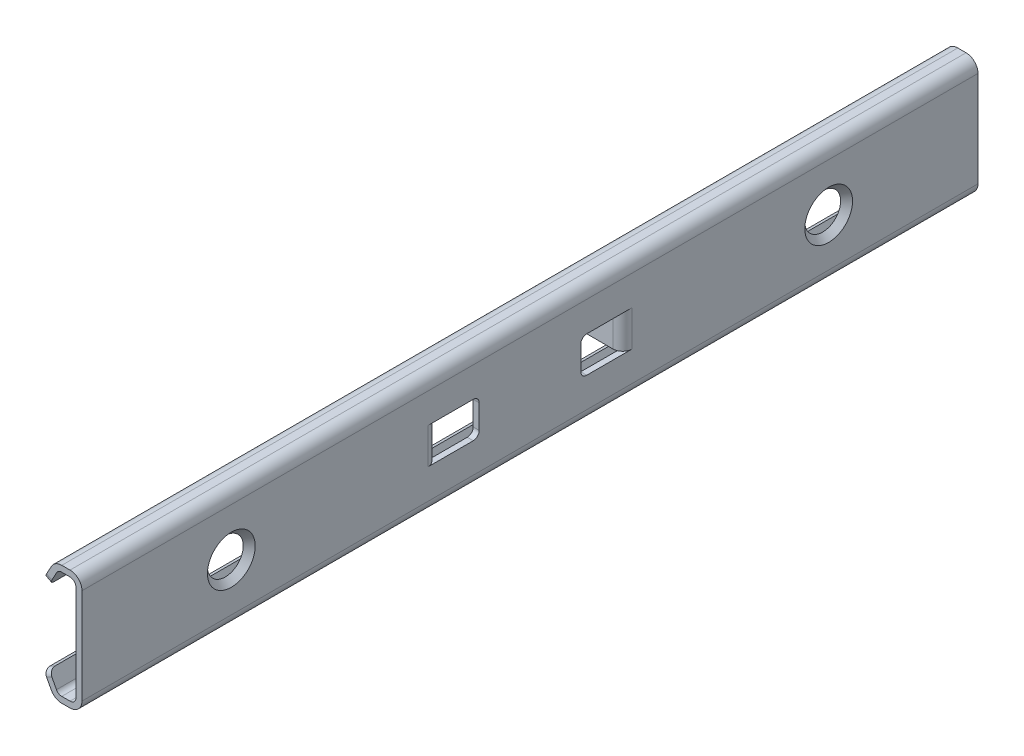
ISO-10303-21;
HEADER;
FILE_DESCRIPTION(('STEP AP214'),'2;1');
FILE_NAME('part.step','',(''),(''),'','','');
FILE_SCHEMA(('AUTOMOTIVE_DESIGN { 1 0 10303 214 1 1 1 1 }'));
ENDSEC;
DATA;
#1=APPLICATION_CONTEXT('core data for automotive mechanical design processes');
#2=APPLICATION_PROTOCOL_DEFINITION('international standard','automotive_design',2000,#1);
#3=PRODUCT_CONTEXT('',#1,'mechanical');
#4=PRODUCT('Part','Part','',(#3));
#5=PRODUCT_RELATED_PRODUCT_CATEGORY('part','',(#4));
#6=PRODUCT_DEFINITION_FORMATION('','',#4);
#7=PRODUCT_DEFINITION_CONTEXT('part definition',#1,'design');
#8=PRODUCT_DEFINITION('design','',#6,#7);
#9=PRODUCT_DEFINITION_SHAPE('','',#8);
#10=(LENGTH_UNIT() NAMED_UNIT(*) SI_UNIT(.MILLI.,.METRE.));
#11=(NAMED_UNIT(*) PLANE_ANGLE_UNIT() SI_UNIT($,.RADIAN.));
#12=(NAMED_UNIT(*) SI_UNIT($,.STERADIAN.) SOLID_ANGLE_UNIT());
#13=UNCERTAINTY_MEASURE_WITH_UNIT(LENGTH_MEASURE(1.E-05),#10,'distance_accuracy_value','');
#14=(GEOMETRIC_REPRESENTATION_CONTEXT(3) GLOBAL_UNCERTAINTY_ASSIGNED_CONTEXT((#13)) GLOBAL_UNIT_ASSIGNED_CONTEXT((#10,
#11,#12)) REPRESENTATION_CONTEXT('',''));
#15=CARTESIAN_POINT('',(0.,0.,0.));
#16=DIRECTION('',(0.,0.,1.));
#17=DIRECTION('',(1.,0.,0.));
#18=AXIS2_PLACEMENT_3D('',#15,#16,#17);
#19=CARTESIAN_POINT('',(-1.5,-3.,-16.5));
#20=DIRECTION('',(0.,-1.,0.));
#21=DIRECTION('',(0.,0.,-1.));
#22=AXIS2_PLACEMENT_3D('',#19,#20,#21);
#23=PLANE('',#22);
#24=DIRECTION('',(0.,0.,-1.));
#25=VECTOR('',#24,1.);
#26=CARTESIAN_POINT('',(7.5,-3.,75.));
#27=LINE('',#26,#25);
#28=CARTESIAN_POINT('',(7.5,-3.,-9.49999999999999));
#29=VERTEX_POINT('',#28);
#30=CARTESIAN_POINT('',(7.5,-3.,-15.6167603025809));
#31=VERTEX_POINT('',#30);
#32=EDGE_CURVE('E408',#29,#31,#27,.T.);
#33=ORIENTED_EDGE('',*,*,#32,.F.);
#34=DIRECTION('',(1.,0.,0.));
#35=VECTOR('',#34,1.);
#36=CARTESIAN_POINT('',(8.5,-3.,-9.5));
#37=LINE('',#36,#35);
#38=CARTESIAN_POINT('',(8.5,-3.,-9.5));
#39=VERTEX_POINT('',#38);
#40=EDGE_CURVE('E536',#29,#39,#37,.T.);
#41=ORIENTED_EDGE('',*,*,#40,.T.);
#42=DIRECTION('',(0.,0.,-1.));
#43=VECTOR('',#42,1.);
#44=CARTESIAN_POINT('',(8.5,-3.,-16.5));
#45=LINE('',#44,#43);
#46=CARTESIAN_POINT('',(8.5,-3.,-17.1));
#47=VERTEX_POINT('',#46);
#48=EDGE_CURVE('E609',#39,#47,#45,.T.);
#49=ORIENTED_EDGE('',*,*,#48,.T.);
#50=CARTESIAN_POINT('',(6.9,-3.,-17.1));
#51=DIRECTION('',(0.,-1.,0.));
#52=DIRECTION('',(0.,0.,-1.));
#53=AXIS2_PLACEMENT_3D('',#50,#51,#52);
#54=CIRCLE('',#53,1.6);
#55=EDGE_CURVE('E455',#47,#31,#54,.T.);
#56=ORIENTED_EDGE('',*,*,#55,.T.);
#57=EDGE_LOOP('',(#33,#41,#49,#56));
#58=FACE_BOUND('',#57,.T.);
#59=ADVANCED_FACE('F32',(#58),#23,.F.);
#60=CARTESIAN_POINT('',(-1.5,3.,-16.5));
#61=DIRECTION('',(0.,1.,0.));
#62=DIRECTION('',(0.,0.,1.));
#63=AXIS2_PLACEMENT_3D('',#60,#61,#62);
#64=PLANE('',#63);
#65=DIRECTION('',(0.,0.,1.));
#66=VECTOR('',#65,1.);
#67=CARTESIAN_POINT('',(8.5,3.,-16.5));
#68=LINE('',#67,#66);
#69=CARTESIAN_POINT('',(8.5,3.,-17.1));
#70=VERTEX_POINT('',#69);
#71=CARTESIAN_POINT('',(8.5,3.,-9.5));
#72=VERTEX_POINT('',#71);
#73=EDGE_CURVE('E578',#70,#72,#68,.T.);
#74=ORIENTED_EDGE('',*,*,#73,.T.);
#75=DIRECTION('',(1.,0.,0.));
#76=VECTOR('',#75,1.);
#77=CARTESIAN_POINT('',(7.5,3.,-9.5));
#78=LINE('',#77,#76);
#79=CARTESIAN_POINT('',(7.5,3.,-9.49999999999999));
#80=VERTEX_POINT('',#79);
#81=EDGE_CURVE('E544',#72,#80,#78,.F.);
#82=ORIENTED_EDGE('',*,*,#81,.T.);
#83=DIRECTION('',(0.,0.,1.));
#84=VECTOR('',#83,1.);
#85=CARTESIAN_POINT('',(7.5,3.,75.));
#86=LINE('',#85,#84);
#87=CARTESIAN_POINT('',(7.5,3.,-15.6167603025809));
#88=VERTEX_POINT('',#87);
#89=EDGE_CURVE('E400',#88,#80,#86,.T.);
#90=ORIENTED_EDGE('',*,*,#89,.F.);
#91=CARTESIAN_POINT('',(6.9,3.,-17.1));
#92=DIRECTION('',(0.,1.,0.));
#93=DIRECTION('',(0.,0.,1.));
#94=AXIS2_PLACEMENT_3D('',#91,#92,#93);
#95=CIRCLE('',#94,1.6);
#96=EDGE_CURVE('E458',#88,#70,#95,.T.);
#97=ORIENTED_EDGE('',*,*,#96,.T.);
#98=EDGE_LOOP('',(#74,#82,#90,#97));
#99=FACE_BOUND('',#98,.T.);
#100=ADVANCED_FACE('F585',(#99),#64,.F.);
#101=CARTESIAN_POINT('',(-1.5,-3.,16.5));
#102=DIRECTION('',(0.,-1.,0.));
#103=DIRECTION('',(0.,0.,-1.));
#104=AXIS2_PLACEMENT_3D('',#101,#102,#103);
#105=PLANE('',#104);
#106=DIRECTION('',(0.,0.,-1.));
#107=VECTOR('',#106,1.);
#108=CARTESIAN_POINT('',(8.5,-3.,16.5));
#109=LINE('',#108,#107);
#110=CARTESIAN_POINT('',(8.5,-3.,17.1));
#111=VERTEX_POINT('',#110);
#112=CARTESIAN_POINT('',(8.5,-3.,9.5));
#113=VERTEX_POINT('',#112);
#114=EDGE_CURVE('E391',#111,#113,#109,.T.);
#115=ORIENTED_EDGE('',*,*,#114,.T.);
#116=DIRECTION('',(1.,0.,0.));
#117=VECTOR('',#116,1.);
#118=CARTESIAN_POINT('',(7.49999999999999,-3.,9.5));
#119=LINE('',#118,#117);
#120=CARTESIAN_POINT('',(7.5,-3.,9.49999999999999));
#121=VERTEX_POINT('',#120);
#122=EDGE_CURVE('E516',#113,#121,#119,.F.);
#123=ORIENTED_EDGE('',*,*,#122,.T.);
#124=DIRECTION('',(0.,0.,-1.));
#125=VECTOR('',#124,1.);
#126=CARTESIAN_POINT('',(7.5,-3.,75.));
#127=LINE('',#126,#125);
#128=CARTESIAN_POINT('',(7.5,-3.,15.6167603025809));
#129=VERTEX_POINT('',#128);
#130=EDGE_CURVE('E393',#129,#121,#127,.T.);
#131=ORIENTED_EDGE('',*,*,#130,.F.);
#132=CARTESIAN_POINT('',(6.9,-3.,17.1));
#133=DIRECTION('',(0.,-1.,0.));
#134=DIRECTION('',(0.,0.,-1.));
#135=AXIS2_PLACEMENT_3D('',#132,#133,#134);
#136=CIRCLE('',#135,1.6);
#137=EDGE_CURVE('E461',#129,#111,#136,.T.);
#138=ORIENTED_EDGE('',*,*,#137,.T.);
#139=EDGE_LOOP('',(#115,#123,#131,#138));
#140=FACE_BOUND('',#139,.T.);
#141=ADVANCED_FACE('F778',(#140),#105,.F.);
#142=CARTESIAN_POINT('',(-1.5,3.,16.5));
#143=DIRECTION('',(0.,1.,0.));
#144=DIRECTION('',(0.,0.,1.));
#145=AXIS2_PLACEMENT_3D('',#142,#143,#144);
#146=PLANE('',#145);
#147=DIRECTION('',(0.,0.,1.));
#148=VECTOR('',#147,1.);
#149=CARTESIAN_POINT('',(7.5,3.,75.));
#150=LINE('',#149,#148);
#151=CARTESIAN_POINT('',(7.5,3.,9.49999999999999));
#152=VERTEX_POINT('',#151);
#153=CARTESIAN_POINT('',(7.5,3.,15.6167603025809));
#154=VERTEX_POINT('',#153);
#155=EDGE_CURVE('E380',#152,#154,#150,.T.);
#156=ORIENTED_EDGE('',*,*,#155,.F.);
#157=DIRECTION('',(1.,0.,0.));
#158=VECTOR('',#157,1.);
#159=CARTESIAN_POINT('',(8.5,3.,9.5));
#160=LINE('',#159,#158);
#161=CARTESIAN_POINT('',(8.5,3.,9.5));
#162=VERTEX_POINT('',#161);
#163=EDGE_CURVE('E508',#152,#162,#160,.T.);
#164=ORIENTED_EDGE('',*,*,#163,.T.);
#165=DIRECTION('',(0.,0.,1.));
#166=VECTOR('',#165,1.);
#167=CARTESIAN_POINT('',(8.5,3.,16.5));
#168=LINE('',#167,#166);
#169=CARTESIAN_POINT('',(8.5,3.,17.1));
#170=VERTEX_POINT('',#169);
#171=EDGE_CURVE('E618',#162,#170,#168,.T.);
#172=ORIENTED_EDGE('',*,*,#171,.T.);
#173=CARTESIAN_POINT('',(6.9,3.,17.1));
#174=DIRECTION('',(0.,1.,0.));
#175=DIRECTION('',(0.,0.,1.));
#176=AXIS2_PLACEMENT_3D('',#173,#174,#175);
#177=CIRCLE('',#176,1.6);
#178=EDGE_CURVE('E464',#170,#154,#177,.T.);
#179=ORIENTED_EDGE('',*,*,#178,.T.);
#180=EDGE_LOOP('',(#156,#164,#172,#179));
#181=FACE_BOUND('',#180,.T.);
#182=ADVANCED_FACE('F790',(#181),#146,.F.);
#183=CARTESIAN_POINT('',(7.00626377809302,-15.7929945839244,75.));
#184=DIRECTION('',(0.882352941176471,0.470588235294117,0.));
#185=DIRECTION('',(-0.470588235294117,0.882352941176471,0.));
#186=AXIS2_PLACEMENT_3D('',#183,#184,#185);
#187=PLANE('',#186);
#188=DIRECTION('',(0.,0.,-1.));
#189=VECTOR('',#188,1.);
#190=CARTESIAN_POINT('',(2.11274509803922,-6.61764705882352,75.));
#191=LINE('',#190,#189);
#192=CARTESIAN_POINT('',(2.11274509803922,-6.61764705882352,74.));
#193=VERTEX_POINT('',#192);
#194=CARTESIAN_POINT('',(2.11274509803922,-6.61764705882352,-74.));
#195=VERTEX_POINT('',#194);
#196=EDGE_CURVE('E662',#193,#195,#191,.T.);
#197=ORIENTED_EDGE('',*,*,#196,.T.);
#198=CARTESIAN_POINT('',(2.58333333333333,-7.5,-74.));
#199=DIRECTION('',(0.882352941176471,0.470588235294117,0.));
#200=DIRECTION('',(-0.470588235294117,0.882352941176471,0.));
#201=AXIS2_PLACEMENT_3D('',#198,#199,#200);
#202=CIRCLE('',#201,1.);
#203=CARTESIAN_POINT('',(2.58333333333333,-7.49999999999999,-75.));
#204=VERTEX_POINT('',#203);
#205=EDGE_CURVE('E489',#195,#204,#202,.F.);
#206=ORIENTED_EDGE('',*,*,#205,.T.);
#207=DIRECTION('',(0.470588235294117,-0.882352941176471,0.));
#208=VECTOR('',#207,1.);
#209=CARTESIAN_POINT('',(7.00626377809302,-15.7929945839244,-75.));
#210=LINE('',#209,#208);
#211=CARTESIAN_POINT('',(3.35196078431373,-8.94117647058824,-75.));
#212=VERTEX_POINT('',#211);
#213=EDGE_CURVE('E376',#204,#212,#210,.T.);
#214=ORIENTED_EDGE('',*,*,#213,.T.);
#215=DIRECTION('',(0.,0.,-1.));
#216=VECTOR('',#215,1.);
#217=CARTESIAN_POINT('',(3.35196078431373,-8.94117647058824,75.));
#218=LINE('',#217,#216);
#219=CARTESIAN_POINT('',(3.35196078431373,-8.94117647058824,75.));
#220=VERTEX_POINT('',#219);
#221=EDGE_CURVE('E367',#220,#212,#218,.T.);
#222=ORIENTED_EDGE('',*,*,#221,.F.);
#223=DIRECTION('',(0.470588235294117,-0.882352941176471,0.));
#224=VECTOR('',#223,1.);
#225=CARTESIAN_POINT('',(7.00626377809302,-15.7929945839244,75.));
#226=LINE('',#225,#224);
#227=CARTESIAN_POINT('',(2.58333333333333,-7.49999999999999,75.));
#228=VERTEX_POINT('',#227);
#229=EDGE_CURVE('E351',#228,#220,#226,.T.);
#230=ORIENTED_EDGE('',*,*,#229,.F.);
#231=CARTESIAN_POINT('',(2.58333333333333,-7.5,74.));
#232=DIRECTION('',(0.882352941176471,0.470588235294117,0.));
#233=DIRECTION('',(-0.470588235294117,0.882352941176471,0.));
#234=AXIS2_PLACEMENT_3D('',#231,#232,#233);
#235=CIRCLE('',#234,1.);
#236=EDGE_CURVE('E487',#228,#193,#235,.F.);
#237=ORIENTED_EDGE('',*,*,#236,.T.);
#238=EDGE_LOOP('',(#197,#206,#214,#222,#230,#237));
#239=FACE_BOUND('',#238,.T.);
#240=ADVANCED_FACE('F374',(#239),#187,.F.);
#241=CARTESIAN_POINT('',(5.11666666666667,-8.,75.));
#242=DIRECTION('',(0.,0.,-1.));
#243=DIRECTION('',(-1.,0.,0.));
#244=AXIS2_PLACEMENT_3D('',#241,#242,#243);
#245=CYLINDRICAL_SURFACE('',#244,2.);
#246=CARTESIAN_POINT('',(5.11666666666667,-8.,-75.));
#247=DIRECTION('',(0.,0.,1.));
#248=DIRECTION('',(1.,0.,0.));
#249=AXIS2_PLACEMENT_3D('',#246,#247,#248);
#250=CIRCLE('',#249,2.);
#251=CARTESIAN_POINT('',(5.11666666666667,-10.,-75.));
#252=VERTEX_POINT('',#251);
#253=EDGE_CURVE('E664',#212,#252,#250,.T.);
#254=ORIENTED_EDGE('',*,*,#253,.T.);
#255=DIRECTION('',(0.,0.,-1.));
#256=VECTOR('',#255,1.);
#257=CARTESIAN_POINT('',(5.11666666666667,-10.,75.));
#258=LINE('',#257,#256);
#259=CARTESIAN_POINT('',(5.11666666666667,-10.,75.));
#260=VERTEX_POINT('',#259);
#261=EDGE_CURVE('E369',#260,#252,#258,.T.);
#262=ORIENTED_EDGE('',*,*,#261,.F.);
#263=CARTESIAN_POINT('',(5.11666666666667,-8.,75.));
#264=DIRECTION('',(0.,0.,1.));
#265=DIRECTION('',(1.,0.,0.));
#266=AXIS2_PLACEMENT_3D('',#263,#264,#265);
#267=CIRCLE('',#266,2.);
#268=EDGE_CURVE('E355',#220,#260,#267,.T.);
#269=ORIENTED_EDGE('',*,*,#268,.F.);
#270=ORIENTED_EDGE('',*,*,#221,.T.);
#271=EDGE_LOOP('',(#254,#262,#269,#270));
#272=FACE_BOUND('',#271,.T.);
#273=ADVANCED_FACE('F366',(#272),#245,.T.);
#274=CARTESIAN_POINT('',(4.90892030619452,-10.,75.));
#275=DIRECTION('',(0.,1.,0.));
#276=DIRECTION('',(0.,0.,1.));
#277=AXIS2_PLACEMENT_3D('',#274,#275,#276);
#278=PLANE('',#277);
#279=DIRECTION('',(1.,0.,0.));
#280=VECTOR('',#279,1.);
#281=CARTESIAN_POINT('',(4.90892030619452,-10.,-75.));
#282=LINE('',#281,#280);
#283=CARTESIAN_POINT('',(6.5,-10.,-75.));
#284=VERTEX_POINT('',#283);
#285=EDGE_CURVE('E666',#252,#284,#282,.T.);
#286=ORIENTED_EDGE('',*,*,#285,.T.);
#287=DIRECTION('',(0.,0.,-1.));
#288=VECTOR('',#287,1.);
#289=CARTESIAN_POINT('',(6.5,-10.,75.));
#290=LINE('',#289,#288);
#291=CARTESIAN_POINT('',(6.5,-10.,75.));
#292=VERTEX_POINT('',#291);
#293=EDGE_CURVE('E382',#292,#284,#290,.T.);
#294=ORIENTED_EDGE('',*,*,#293,.F.);
#295=DIRECTION('',(1.,0.,0.));
#296=VECTOR('',#295,1.);
#297=CARTESIAN_POINT('',(4.90892030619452,-10.,75.));
#298=LINE('',#297,#296);
#299=EDGE_CURVE('E371',#260,#292,#298,.T.);
#300=ORIENTED_EDGE('',*,*,#299,.F.);
#301=ORIENTED_EDGE('',*,*,#261,.T.);
#302=EDGE_LOOP('',(#286,#294,#300,#301));
#303=FACE_BOUND('',#302,.T.);
#304=ADVANCED_FACE('F764',(#303),#278,.F.);
#305=CARTESIAN_POINT('',(6.5,-8.,75.));
#306=DIRECTION('',(0.,0.,-1.));
#307=DIRECTION('',(-1.,0.,0.));
#308=AXIS2_PLACEMENT_3D('',#305,#306,#307);
#309=CYLINDRICAL_SURFACE('',#308,2.);
#310=CARTESIAN_POINT('',(6.5,-8.,-75.));
#311=DIRECTION('',(0.,0.,1.));
#312=DIRECTION('',(1.,0.,0.));
#313=AXIS2_PLACEMENT_3D('',#310,#311,#312);
#314=CIRCLE('',#313,2.);
#315=CARTESIAN_POINT('',(8.5,-8.,-75.));
#316=VERTEX_POINT('',#315);
#317=EDGE_CURVE('E668',#284,#316,#314,.T.);
#318=ORIENTED_EDGE('',*,*,#317,.T.);
#319=DIRECTION('',(0.,0.,-1.));
#320=VECTOR('',#319,1.);
#321=CARTESIAN_POINT('',(8.5,-8.,75.));
#322=LINE('',#321,#320);
#323=CARTESIAN_POINT('',(8.5,-8.,75.));
#324=VERTEX_POINT('',#323);
#325=EDGE_CURVE('E745',#324,#316,#322,.T.);
#326=ORIENTED_EDGE('',*,*,#325,.F.);
#327=CARTESIAN_POINT('',(6.5,-8.,75.));
#328=DIRECTION('',(0.,0.,1.));
#329=DIRECTION('',(1.,0.,0.));
#330=AXIS2_PLACEMENT_3D('',#327,#328,#329);
#331=CIRCLE('',#330,2.);
#332=EDGE_CURVE('E626',#292,#324,#331,.T.);
#333=ORIENTED_EDGE('',*,*,#332,.F.);
#334=ORIENTED_EDGE('',*,*,#293,.T.);
#335=EDGE_LOOP('',(#318,#326,#333,#334));
#336=FACE_BOUND('',#335,.T.);
#337=ADVANCED_FACE('F752',(#336),#309,.T.);
#338=CARTESIAN_POINT('',(8.5,-16.911577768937,75.));
#339=DIRECTION('',(-1.,0.,0.));
#340=DIRECTION('',(0.,0.,1.));
#341=AXIS2_PLACEMENT_3D('',#338,#339,#340);
#342=PLANE('',#341);
#343=CARTESIAN_POINT('',(8.5,0.,-50.));
#344=DIRECTION('',(-1.,0.,0.));
#345=DIRECTION('',(0.,0.,1.));
#346=AXIS2_PLACEMENT_3D('',#343,#344,#345);
#347=CIRCLE('',#346,3.99999999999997);
#348=CARTESIAN_POINT('',(8.5,0.,-46.));
#349=VERTEX_POINT('',#348);
#350=EDGE_CURVE('E470',#349,#349,#347,.T.);
#351=ORIENTED_EDGE('',*,*,#350,.T.);
#352=EDGE_LOOP('',(#351));
#353=FACE_BOUND('',#352,.T.);
#354=CARTESIAN_POINT('',(8.5,0.,50.));
#355=DIRECTION('',(-1.,0.,0.));
#356=DIRECTION('',(0.,0.,1.));
#357=AXIS2_PLACEMENT_3D('',#354,#355,#356);
#358=CIRCLE('',#357,4.00000000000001);
#359=CARTESIAN_POINT('',(8.5,0.,54.));
#360=VERTEX_POINT('',#359);
#361=EDGE_CURVE('E467',#360,#360,#358,.T.);
#362=ORIENTED_EDGE('',*,*,#361,.T.);
#363=EDGE_LOOP('',(#362));
#364=FACE_BOUND('',#363,.T.);
#365=ORIENTED_EDGE('',*,*,#114,.F.);
#366=DIRECTION('',(0.,-1.,0.));
#367=VECTOR('',#366,1.);
#368=CARTESIAN_POINT('',(8.5,-16.911577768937,17.1));
#369=LINE('',#368,#367);
#370=EDGE_CURVE('E432',#111,#170,#369,.F.);
#371=ORIENTED_EDGE('',*,*,#370,.T.);
#372=ORIENTED_EDGE('',*,*,#171,.F.);
#373=CARTESIAN_POINT('',(8.5,2.,9.5));
#374=DIRECTION('',(-1.,0.,0.));
#375=DIRECTION('',(0.,0.,1.));
#376=AXIS2_PLACEMENT_3D('',#373,#374,#375);
#377=CIRCLE('',#376,1.);
#378=CARTESIAN_POINT('',(8.5,2.,8.5));
#379=VERTEX_POINT('',#378);
#380=EDGE_CURVE('E562',#162,#379,#377,.T.);
#381=ORIENTED_EDGE('',*,*,#380,.T.);
#382=DIRECTION('',(0.,1.,0.));
#383=VECTOR('',#382,1.);
#384=CARTESIAN_POINT('',(8.5,-3.,8.5));
#385=LINE('',#384,#383);
#386=CARTESIAN_POINT('',(8.5,-2.,8.5));
#387=VERTEX_POINT('',#386);
#388=EDGE_CURVE('E615',#387,#379,#385,.T.);
#389=ORIENTED_EDGE('',*,*,#388,.F.);
#390=CARTESIAN_POINT('',(8.5,-2.,9.5));
#391=DIRECTION('',(-1.,0.,0.));
#392=DIRECTION('',(0.,0.,1.));
#393=AXIS2_PLACEMENT_3D('',#390,#391,#392);
#394=CIRCLE('',#393,1.);
#395=EDGE_CURVE('E566',#387,#113,#394,.T.);
#396=ORIENTED_EDGE('',*,*,#395,.T.);
#397=EDGE_LOOP('',(#365,#371,#372,#381,#389,#396));
#398=FACE_BOUND('',#397,.T.);
#399=DIRECTION('',(0.,-1.,0.));
#400=VECTOR('',#399,1.);
#401=CARTESIAN_POINT('',(8.5,-16.911577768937,-17.1));
#402=LINE('',#401,#400);
#403=EDGE_CURVE('E435',#70,#47,#402,.T.);
#404=ORIENTED_EDGE('',*,*,#403,.T.);
#405=ORIENTED_EDGE('',*,*,#48,.F.);
#406=CARTESIAN_POINT('',(8.5,-2.,-9.5));
#407=DIRECTION('',(-1.,0.,0.));
#408=DIRECTION('',(0.,0.,1.));
#409=AXIS2_PLACEMENT_3D('',#406,#407,#408);
#410=CIRCLE('',#409,1.);
#411=CARTESIAN_POINT('',(8.5,-2.,-8.5));
#412=VERTEX_POINT('',#411);
#413=EDGE_CURVE('E570',#39,#412,#410,.T.);
#414=ORIENTED_EDGE('',*,*,#413,.T.);
#415=DIRECTION('',(0.,-1.,0.));
#416=VECTOR('',#415,1.);
#417=CARTESIAN_POINT('',(8.5,-3.,-8.5));
#418=LINE('',#417,#416);
#419=CARTESIAN_POINT('',(8.5,2.,-8.5));
#420=VERTEX_POINT('',#419);
#421=EDGE_CURVE('E580',#420,#412,#418,.T.);
#422=ORIENTED_EDGE('',*,*,#421,.F.);
#423=CARTESIAN_POINT('',(8.5,2.,-9.5));
#424=DIRECTION('',(-1.,0.,0.));
#425=DIRECTION('',(0.,0.,1.));
#426=AXIS2_PLACEMENT_3D('',#423,#424,#425);
#427=CIRCLE('',#426,1.);
#428=EDGE_CURVE('E40',#420,#72,#427,.T.);
#429=ORIENTED_EDGE('',*,*,#428,.T.);
#430=ORIENTED_EDGE('',*,*,#73,.F.);
#431=EDGE_LOOP('',(#404,#405,#414,#422,#429,#430));
#432=FACE_BOUND('',#431,.T.);
#433=DIRECTION('',(0.,1.,0.));
#434=VECTOR('',#433,1.);
#435=CARTESIAN_POINT('',(8.5,-16.911577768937,-75.));
#436=LINE('',#435,#434);
#437=CARTESIAN_POINT('',(8.5,8.,-75.));
#438=VERTEX_POINT('',#437);
#439=EDGE_CURVE('E670',#316,#438,#436,.T.);
#440=ORIENTED_EDGE('',*,*,#439,.T.);
#441=DIRECTION('',(0.,0.,-1.));
#442=VECTOR('',#441,1.);
#443=CARTESIAN_POINT('',(8.5,8.,75.));
#444=LINE('',#443,#442);
#445=CARTESIAN_POINT('',(8.5,8.,75.));
#446=VERTEX_POINT('',#445);
#447=EDGE_CURVE('E743',#446,#438,#444,.T.);
#448=ORIENTED_EDGE('',*,*,#447,.F.);
#449=DIRECTION('',(0.,1.,0.));
#450=VECTOR('',#449,1.);
#451=CARTESIAN_POINT('',(8.5,-16.911577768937,75.));
#452=LINE('',#451,#450);
#453=EDGE_CURVE('E628',#324,#446,#452,.T.);
#454=ORIENTED_EDGE('',*,*,#453,.F.);
#455=ORIENTED_EDGE('',*,*,#325,.T.);
#456=EDGE_LOOP('',(#440,#448,#454,#455));
#457=FACE_BOUND('',#456,.T.);
#458=ADVANCED_FACE('F576',(#353,#364,#398,#432,#457),#342,.F.);
#459=CARTESIAN_POINT('',(6.5,8.,75.));
#460=DIRECTION('',(0.,0.,-1.));
#461=DIRECTION('',(-1.,0.,0.));
#462=AXIS2_PLACEMENT_3D('',#459,#460,#461);
#463=CYLINDRICAL_SURFACE('',#462,2.);
#464=CARTESIAN_POINT('',(6.5,8.,-75.));
#465=DIRECTION('',(0.,0.,1.));
#466=DIRECTION('',(1.,0.,0.));
#467=AXIS2_PLACEMENT_3D('',#464,#465,#466);
#468=CIRCLE('',#467,2.);
#469=CARTESIAN_POINT('',(6.5,10.,-75.));
#470=VERTEX_POINT('',#469);
#471=EDGE_CURVE('E673',#470,#438,#468,.F.);
#472=ORIENTED_EDGE('',*,*,#471,.F.);
#473=DIRECTION('',(0.,0.,-1.));
#474=VECTOR('',#473,1.);
#475=CARTESIAN_POINT('',(6.5,10.,75.));
#476=LINE('',#475,#474);
#477=CARTESIAN_POINT('',(6.5,10.,75.));
#478=VERTEX_POINT('',#477);
#479=EDGE_CURVE('E741',#478,#470,#476,.T.);
#480=ORIENTED_EDGE('',*,*,#479,.F.);
#481=CARTESIAN_POINT('',(6.5,8.,75.));
#482=DIRECTION('',(0.,0.,1.));
#483=DIRECTION('',(1.,0.,0.));
#484=AXIS2_PLACEMENT_3D('',#481,#482,#483);
#485=CIRCLE('',#484,2.);
#486=EDGE_CURVE('E630',#478,#446,#485,.F.);
#487=ORIENTED_EDGE('',*,*,#486,.T.);
#488=ORIENTED_EDGE('',*,*,#447,.T.);
#489=EDGE_LOOP('',(#472,#480,#487,#488));
#490=FACE_BOUND('',#489,.T.);
#491=ADVANCED_FACE('F855',(#490),#463,.T.);
#492=CARTESIAN_POINT('',(4.90892030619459,10.,75.));
#493=DIRECTION('',(0.,1.,0.));
#494=DIRECTION('',(-1.,0.,0.));
#495=AXIS2_PLACEMENT_3D('',#492,#493,#494);
#496=PLANE('',#495);
#497=DIRECTION('',(1.,0.,0.));
#498=VECTOR('',#497,1.);
#499=CARTESIAN_POINT('',(4.90892030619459,10.,-75.));
#500=LINE('',#499,#498);
#501=CARTESIAN_POINT('',(5.11666666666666,10.,-75.));
#502=VERTEX_POINT('',#501);
#503=EDGE_CURVE('E676',#502,#470,#500,.T.);
#504=ORIENTED_EDGE('',*,*,#503,.F.);
#505=DIRECTION('',(0.,0.,-1.));
#506=VECTOR('',#505,1.);
#507=CARTESIAN_POINT('',(5.11666666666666,10.,75.));
#508=LINE('',#507,#506);
#509=CARTESIAN_POINT('',(5.11666666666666,10.,75.));
#510=VERTEX_POINT('',#509);
#511=EDGE_CURVE('E739',#510,#502,#508,.T.);
#512=ORIENTED_EDGE('',*,*,#511,.F.);
#513=DIRECTION('',(1.,0.,0.));
#514=VECTOR('',#513,1.);
#515=CARTESIAN_POINT('',(4.90892030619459,10.,75.));
#516=LINE('',#515,#514);
#517=EDGE_CURVE('E633',#510,#478,#516,.T.);
#518=ORIENTED_EDGE('',*,*,#517,.T.);
#519=ORIENTED_EDGE('',*,*,#479,.T.);
#520=EDGE_LOOP('',(#504,#512,#518,#519));
#521=FACE_BOUND('',#520,.T.);
#522=ADVANCED_FACE('F851',(#521),#496,.T.);
#523=CARTESIAN_POINT('',(5.11666666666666,8.,75.));
#524=DIRECTION('',(0.,0.,-1.));
#525=DIRECTION('',(-1.,0.,0.));
#526=AXIS2_PLACEMENT_3D('',#523,#524,#525);
#527=CYLINDRICAL_SURFACE('',#526,2.);
#528=CARTESIAN_POINT('',(5.11666666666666,8.,-75.));
#529=DIRECTION('',(0.,0.,1.));
#530=DIRECTION('',(1.,0.,0.));
#531=AXIS2_PLACEMENT_3D('',#528,#529,#530);
#532=CIRCLE('',#531,2.);
#533=CARTESIAN_POINT('',(3.35196078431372,8.94117647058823,-75.));
#534=VERTEX_POINT('',#533);
#535=EDGE_CURVE('E679',#534,#502,#532,.F.);
#536=ORIENTED_EDGE('',*,*,#535,.F.);
#537=DIRECTION('',(0.,0.,-1.));
#538=VECTOR('',#537,1.);
#539=CARTESIAN_POINT('',(3.35196078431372,8.94117647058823,75.));
#540=LINE('',#539,#538);
#541=CARTESIAN_POINT('',(3.35196078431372,8.94117647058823,75.));
#542=VERTEX_POINT('',#541);
#543=EDGE_CURVE('E736',#542,#534,#540,.T.);
#544=ORIENTED_EDGE('',*,*,#543,.F.);
#545=CARTESIAN_POINT('',(5.11666666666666,8.,75.));
#546=DIRECTION('',(0.,0.,1.));
#547=DIRECTION('',(1.,0.,0.));
#548=AXIS2_PLACEMENT_3D('',#545,#546,#547);
#549=CIRCLE('',#548,2.);
#550=EDGE_CURVE('E636',#542,#510,#549,.F.);
#551=ORIENTED_EDGE('',*,*,#550,.T.);
#552=ORIENTED_EDGE('',*,*,#511,.T.);
#553=EDGE_LOOP('',(#536,#544,#551,#552));
#554=FACE_BOUND('',#553,.T.);
#555=ADVANCED_FACE('F847',(#554),#527,.T.);
#556=CARTESIAN_POINT('',(-7.03795305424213,-10.5399119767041,75.));
#557=DIRECTION('',(-0.882352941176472,0.470588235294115,0.));
#558=DIRECTION('',(-0.470588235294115,-0.882352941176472,0.));
#559=AXIS2_PLACEMENT_3D('',#556,#557,#558);
#560=PLANE('',#559);
#561=DIRECTION('',(0.470588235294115,0.882352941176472,0.));
#562=VECTOR('',#561,1.);
#563=CARTESIAN_POINT('',(-7.03795305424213,-10.5399119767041,-75.));
#564=LINE('',#563,#562);
#565=CARTESIAN_POINT('',(2.58333333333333,7.5,-75.));
#566=VERTEX_POINT('',#565);
#567=EDGE_CURVE('E682',#566,#534,#564,.T.);
#568=ORIENTED_EDGE('',*,*,#567,.F.);
#569=CARTESIAN_POINT('',(2.58333333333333,7.49999999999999,-74.));
#570=DIRECTION('',(-0.882352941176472,0.470588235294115,0.));
#571=DIRECTION('',(-0.470588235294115,-0.882352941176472,0.));
#572=AXIS2_PLACEMENT_3D('',#569,#570,#571);
#573=CIRCLE('',#572,1.);
#574=CARTESIAN_POINT('',(2.11274509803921,6.61764705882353,-74.));
#575=VERTEX_POINT('',#574);
#576=EDGE_CURVE('E502',#566,#575,#573,.T.);
#577=ORIENTED_EDGE('',*,*,#576,.T.);
#578=DIRECTION('',(0.,0.,-1.));
#579=VECTOR('',#578,1.);
#580=CARTESIAN_POINT('',(2.11274509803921,6.61764705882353,75.));
#581=LINE('',#580,#579);
#582=CARTESIAN_POINT('',(2.11274509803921,6.61764705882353,74.));
#583=VERTEX_POINT('',#582);
#584=EDGE_CURVE('E733',#583,#575,#581,.T.);
#585=ORIENTED_EDGE('',*,*,#584,.F.);
#586=CARTESIAN_POINT('',(2.58333333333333,7.49999999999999,74.));
#587=DIRECTION('',(-0.882352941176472,0.470588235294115,0.));
#588=DIRECTION('',(-0.470588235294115,-0.882352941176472,0.));
#589=AXIS2_PLACEMENT_3D('',#586,#587,#588);
#590=CIRCLE('',#589,1.);
#591=CARTESIAN_POINT('',(2.58333333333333,7.49999999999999,75.));
#592=VERTEX_POINT('',#591);
#593=EDGE_CURVE('E500',#583,#592,#590,.T.);
#594=ORIENTED_EDGE('',*,*,#593,.T.);
#595=DIRECTION('',(0.470588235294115,0.882352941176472,0.));
#596=VECTOR('',#595,1.);
#597=CARTESIAN_POINT('',(-7.03795305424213,-10.5399119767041,75.));
#598=LINE('',#597,#596);
#599=EDGE_CURVE('E639',#592,#542,#598,.T.);
#600=ORIENTED_EDGE('',*,*,#599,.T.);
#601=ORIENTED_EDGE('',*,*,#543,.T.);
#602=EDGE_LOOP('',(#568,#577,#585,#594,#600,#601));
#603=FACE_BOUND('',#602,.T.);
#604=ADVANCED_FACE('F843',(#603),#560,.T.);
#605=CARTESIAN_POINT('',(14.0596184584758,0.245981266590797,75.));
#606=DIRECTION('',(0.470588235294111,0.882352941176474,0.));
#607=DIRECTION('',(-0.882352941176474,0.470588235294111,0.));
#608=AXIS2_PLACEMENT_3D('',#605,#606,#607);
#609=PLANE('',#608);
#610=ORIENTED_EDGE('',*,*,#584,.T.);
#611=DIRECTION('',(0.882352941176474,-0.470588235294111,0.));
#612=VECTOR('',#611,1.);
#613=CARTESIAN_POINT('',(14.0596184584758,0.245981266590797,-74.));
#614=LINE('',#613,#612);
#615=CARTESIAN_POINT('',(2.99509803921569,6.14705882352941,-74.));
#616=VERTEX_POINT('',#615);
#617=EDGE_CURVE('E493',#575,#616,#614,.T.);
#618=ORIENTED_EDGE('',*,*,#617,.T.);
#619=DIRECTION('',(0.,0.,-1.));
#620=VECTOR('',#619,1.);
#621=CARTESIAN_POINT('',(2.99509803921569,6.14705882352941,75.));
#622=LINE('',#621,#620);
#623=CARTESIAN_POINT('',(2.99509803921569,6.14705882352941,74.));
#624=VERTEX_POINT('',#623);
#625=EDGE_CURVE('E730',#624,#616,#622,.T.);
#626=ORIENTED_EDGE('',*,*,#625,.F.);
#627=DIRECTION('',(0.882352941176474,-0.470588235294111,0.));
#628=VECTOR('',#627,1.);
#629=CARTESIAN_POINT('',(2.11274509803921,6.61764705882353,74.));
#630=LINE('',#629,#628);
#631=EDGE_CURVE('E491',#624,#583,#630,.F.);
#632=ORIENTED_EDGE('',*,*,#631,.T.);
#633=EDGE_LOOP('',(#610,#618,#626,#632));
#634=FACE_BOUND('',#633,.T.);
#635=ADVANCED_FACE('F839',(#634),#609,.F.);
#636=CARTESIAN_POINT('',(-6.15560011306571,-11.0105002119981,75.));
#637=DIRECTION('',(-0.88235294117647,0.470588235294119,0.));
#638=DIRECTION('',(-0.470588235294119,-0.88235294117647,0.));
#639=AXIS2_PLACEMENT_3D('',#636,#637,#638);
#640=PLANE('',#639);
#641=ORIENTED_EDGE('',*,*,#625,.T.);
#642=CARTESIAN_POINT('',(3.46568627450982,7.02941176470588,-74.));
#643=DIRECTION('',(-0.88235294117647,0.470588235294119,0.));
#644=DIRECTION('',(-0.470588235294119,-0.88235294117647,0.));
#645=AXIS2_PLACEMENT_3D('',#642,#643,#644);
#646=CIRCLE('',#645,1.);
#647=CARTESIAN_POINT('',(3.46568627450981,7.02941176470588,-75.));
#648=VERTEX_POINT('',#647);
#649=EDGE_CURVE('E498',#616,#648,#646,.F.);
#650=ORIENTED_EDGE('',*,*,#649,.T.);
#651=DIRECTION('',(0.470588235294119,0.88235294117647,0.));
#652=VECTOR('',#651,1.);
#653=CARTESIAN_POINT('',(-6.15560011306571,-11.0105002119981,-75.));
#654=LINE('',#653,#652);
#655=CARTESIAN_POINT('',(4.23431372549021,8.47058823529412,-75.));
#656=VERTEX_POINT('',#655);
#657=EDGE_CURVE('E684',#648,#656,#654,.T.);
#658=ORIENTED_EDGE('',*,*,#657,.T.);
#659=DIRECTION('',(0.,0.,-1.));
#660=VECTOR('',#659,1.);
#661=CARTESIAN_POINT('',(4.23431372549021,8.47058823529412,75.));
#662=LINE('',#661,#660);
#663=CARTESIAN_POINT('',(4.23431372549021,8.47058823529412,75.));
#664=VERTEX_POINT('',#663);
#665=EDGE_CURVE('E727',#664,#656,#662,.T.);
#666=ORIENTED_EDGE('',*,*,#665,.F.);
#667=DIRECTION('',(0.470588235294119,0.88235294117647,0.));
#668=VECTOR('',#667,1.);
#669=CARTESIAN_POINT('',(-6.15560011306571,-11.0105002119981,75.));
#670=LINE('',#669,#668);
#671=CARTESIAN_POINT('',(3.46568627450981,7.02941176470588,75.));
#672=VERTEX_POINT('',#671);
#673=EDGE_CURVE('E641',#672,#664,#670,.T.);
#674=ORIENTED_EDGE('',*,*,#673,.F.);
#675=CARTESIAN_POINT('',(3.46568627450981,7.02941176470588,74.));
#676=DIRECTION('',(-0.88235294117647,0.470588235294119,0.));
#677=DIRECTION('',(-0.470588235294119,-0.88235294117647,0.));
#678=AXIS2_PLACEMENT_3D('',#675,#676,#677);
#679=CIRCLE('',#678,1.);
#680=EDGE_CURVE('E496',#672,#624,#679,.F.);
#681=ORIENTED_EDGE('',*,*,#680,.T.);
#682=EDGE_LOOP('',(#641,#650,#658,#666,#674,#681));
#683=FACE_BOUND('',#682,.T.);
#684=ADVANCED_FACE('F835',(#683),#640,.F.);
#685=CARTESIAN_POINT('',(5.11666666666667,8.,75.));
#686=DIRECTION('',(0.,0.,-1.));
#687=DIRECTION('',(-1.,0.,0.));
#688=AXIS2_PLACEMENT_3D('',#685,#686,#687);
#689=CYLINDRICAL_SURFACE('',#688,1.);
#690=CARTESIAN_POINT('',(5.11666666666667,8.,-75.));
#691=DIRECTION('',(0.,0.,1.));
#692=DIRECTION('',(1.,0.,0.));
#693=AXIS2_PLACEMENT_3D('',#690,#691,#692);
#694=CIRCLE('',#693,1.);
#695=CARTESIAN_POINT('',(5.11666666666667,9.,-75.));
#696=VERTEX_POINT('',#695);
#697=EDGE_CURVE('E686',#656,#696,#694,.F.);
#698=ORIENTED_EDGE('',*,*,#697,.T.);
#699=DIRECTION('',(0.,0.,-1.));
#700=VECTOR('',#699,1.);
#701=CARTESIAN_POINT('',(5.11666666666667,9.,75.));
#702=LINE('',#701,#700);
#703=CARTESIAN_POINT('',(5.11666666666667,9.,75.));
#704=VERTEX_POINT('',#703);
#705=EDGE_CURVE('E724',#704,#696,#702,.T.);
#706=ORIENTED_EDGE('',*,*,#705,.F.);
#707=CARTESIAN_POINT('',(5.11666666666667,8.,75.));
#708=DIRECTION('',(0.,0.,1.));
#709=DIRECTION('',(1.,0.,0.));
#710=AXIS2_PLACEMENT_3D('',#707,#708,#709);
#711=CIRCLE('',#710,1.);
#712=EDGE_CURVE('E643',#664,#704,#711,.F.);
#713=ORIENTED_EDGE('',*,*,#712,.F.);
#714=ORIENTED_EDGE('',*,*,#665,.T.);
#715=EDGE_LOOP('',(#698,#706,#713,#714));
#716=FACE_BOUND('',#715,.T.);
#717=ADVANCED_FACE('F831',(#716),#689,.F.);
#718=CARTESIAN_POINT('',(4.90892030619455,9.,75.));
#719=DIRECTION('',(0.,1.,0.));
#720=DIRECTION('',(-1.,0.,0.));
#721=AXIS2_PLACEMENT_3D('',#718,#719,#720);
#722=PLANE('',#721);
#723=DIRECTION('',(1.,0.,0.));
#724=VECTOR('',#723,1.);
#725=CARTESIAN_POINT('',(4.90892030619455,9.,-75.));
#726=LINE('',#725,#724);
#727=CARTESIAN_POINT('',(6.5,9.,-75.));
#728=VERTEX_POINT('',#727);
#729=EDGE_CURVE('E688',#696,#728,#726,.T.);
#730=ORIENTED_EDGE('',*,*,#729,.T.);
#731=DIRECTION('',(0.,0.,-1.));
#732=VECTOR('',#731,1.);
#733=CARTESIAN_POINT('',(6.5,9.,75.));
#734=LINE('',#733,#732);
#735=CARTESIAN_POINT('',(6.5,9.,75.));
#736=VERTEX_POINT('',#735);
#737=EDGE_CURVE('E721',#736,#728,#734,.T.);
#738=ORIENTED_EDGE('',*,*,#737,.F.);
#739=DIRECTION('',(1.,0.,0.));
#740=VECTOR('',#739,1.);
#741=CARTESIAN_POINT('',(4.90892030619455,9.,75.));
#742=LINE('',#741,#740);
#743=EDGE_CURVE('E645',#704,#736,#742,.T.);
#744=ORIENTED_EDGE('',*,*,#743,.F.);
#745=ORIENTED_EDGE('',*,*,#705,.T.);
#746=EDGE_LOOP('',(#730,#738,#744,#745));
#747=FACE_BOUND('',#746,.T.);
#748=ADVANCED_FACE('F827',(#747),#722,.F.);
#749=CARTESIAN_POINT('',(6.5,8.,75.));
#750=DIRECTION('',(0.,0.,-1.));
#751=DIRECTION('',(-1.,0.,0.));
#752=AXIS2_PLACEMENT_3D('',#749,#750,#751);
#753=CYLINDRICAL_SURFACE('',#752,1.);
#754=CARTESIAN_POINT('',(6.5,8.,-75.));
#755=DIRECTION('',(0.,0.,1.));
#756=DIRECTION('',(1.,0.,0.));
#757=AXIS2_PLACEMENT_3D('',#754,#755,#756);
#758=CIRCLE('',#757,1.);
#759=CARTESIAN_POINT('',(7.5,8.,-75.));
#760=VERTEX_POINT('',#759);
#761=EDGE_CURVE('E690',#728,#760,#758,.F.);
#762=ORIENTED_EDGE('',*,*,#761,.T.);
#763=DIRECTION('',(0.,0.,-1.));
#764=VECTOR('',#763,1.);
#765=CARTESIAN_POINT('',(7.5,8.,75.));
#766=LINE('',#765,#764);
#767=CARTESIAN_POINT('',(7.5,8.,75.));
#768=VERTEX_POINT('',#767);
#769=EDGE_CURVE('E718',#768,#760,#766,.T.);
#770=ORIENTED_EDGE('',*,*,#769,.F.);
#771=CARTESIAN_POINT('',(6.5,8.,75.));
#772=DIRECTION('',(0.,0.,1.));
#773=DIRECTION('',(1.,0.,0.));
#774=AXIS2_PLACEMENT_3D('',#771,#772,#773);
#775=CIRCLE('',#774,1.);
#776=EDGE_CURVE('E647',#736,#768,#775,.F.);
#777=ORIENTED_EDGE('',*,*,#776,.F.);
#778=ORIENTED_EDGE('',*,*,#737,.T.);
#779=EDGE_LOOP('',(#762,#770,#777,#778));
#780=FACE_BOUND('',#779,.T.);
#781=ADVANCED_FACE('F824',(#780),#753,.F.);
#782=CARTESIAN_POINT('',(7.49999999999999,-16.911577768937,75.));
#783=DIRECTION('',(1.,0.,0.));
#784=DIRECTION('',(0.,1.,0.));
#785=AXIS2_PLACEMENT_3D('',#782,#783,#784);
#786=PLANE('',#785);
#787=DIRECTION('',(0.,1.,0.));
#788=VECTOR('',#787,1.);
#789=CARTESIAN_POINT('',(7.5,3.,-17.1));
#790=LINE('',#789,#788);
#791=CARTESIAN_POINT('',(7.5,-3.,-17.1));
#792=VERTEX_POINT('',#791);
#793=CARTESIAN_POINT('',(7.5,3.,-17.1));
#794=VERTEX_POINT('',#793);
#795=EDGE_CURVE('E413',#792,#794,#790,.T.);
#796=ORIENTED_EDGE('',*,*,#795,.T.);
#797=EDGE_CURVE('E401',#794,#88,#86,.T.);
#798=ORIENTED_EDGE('',*,*,#797,.T.);
#799=ORIENTED_EDGE('',*,*,#89,.T.);
#800=CARTESIAN_POINT('',(7.5,2.,-9.5));
#801=DIRECTION('',(1.,0.,0.));
#802=DIRECTION('',(0.,1.,0.));
#803=AXIS2_PLACEMENT_3D('',#800,#801,#802);
#804=CIRCLE('',#803,1.);
#805=CARTESIAN_POINT('',(7.5,2.00000000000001,-8.49999999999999));
#806=VERTEX_POINT('',#805);
#807=EDGE_CURVE('E11',#80,#806,#804,.T.);
#808=ORIENTED_EDGE('',*,*,#807,.T.);
#809=DIRECTION('',(0.,-1.,0.));
#810=VECTOR('',#809,1.);
#811=CARTESIAN_POINT('',(7.49999999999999,-16.911577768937,-8.49999999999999));
#812=LINE('',#811,#810);
#813=CARTESIAN_POINT('',(7.5,-2.,-8.49999999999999));
#814=VERTEX_POINT('',#813);
#815=EDGE_CURVE('E404',#806,#814,#812,.T.);
#816=ORIENTED_EDGE('',*,*,#815,.T.);
#817=CARTESIAN_POINT('',(7.5,-2.,-9.5));
#818=DIRECTION('',(1.,0.,0.));
#819=DIRECTION('',(0.,1.,0.));
#820=AXIS2_PLACEMENT_3D('',#817,#818,#819);
#821=CIRCLE('',#820,1.);
#822=EDGE_CURVE('E572',#814,#29,#821,.T.);
#823=ORIENTED_EDGE('',*,*,#822,.T.);
#824=ORIENTED_EDGE('',*,*,#32,.T.);
#825=EDGE_CURVE('E407',#31,#792,#27,.T.);
#826=ORIENTED_EDGE('',*,*,#825,.T.);
#827=EDGE_LOOP('',(#796,#798,#799,#808,#816,#823,#824,#826));
#828=FACE_BOUND('',#827,.T.);
#829=DIRECTION('',(0.,-1.,0.));
#830=VECTOR('',#829,1.);
#831=CARTESIAN_POINT('',(7.5,-3.,17.1));
#832=LINE('',#831,#830);
#833=CARTESIAN_POINT('',(7.5,3.,17.1));
#834=VERTEX_POINT('',#833);
#835=CARTESIAN_POINT('',(7.5,-3.,17.1));
#836=VERTEX_POINT('',#835);
#837=EDGE_CURVE('E410',#834,#836,#832,.T.);
#838=ORIENTED_EDGE('',*,*,#837,.T.);
#839=EDGE_CURVE('E394',#836,#129,#127,.T.);
#840=ORIENTED_EDGE('',*,*,#839,.T.);
#841=ORIENTED_EDGE('',*,*,#130,.T.);
#842=CARTESIAN_POINT('',(7.5,-2.,9.5));
#843=DIRECTION('',(1.,0.,0.));
#844=DIRECTION('',(0.,1.,0.));
#845=AXIS2_PLACEMENT_3D('',#842,#843,#844);
#846=CIRCLE('',#845,1.);
#847=CARTESIAN_POINT('',(7.5,-2.,8.49999999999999));
#848=VERTEX_POINT('',#847);
#849=EDGE_CURVE('E568',#121,#848,#846,.T.);
#850=ORIENTED_EDGE('',*,*,#849,.T.);
#851=DIRECTION('',(0.,1.,0.));
#852=VECTOR('',#851,1.);
#853=CARTESIAN_POINT('',(7.49999999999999,-16.911577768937,8.49999999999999));
#854=LINE('',#853,#852);
#855=CARTESIAN_POINT('',(7.5,2.00000000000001,8.49999999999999));
#856=VERTEX_POINT('',#855);
#857=EDGE_CURVE('E397',#848,#856,#854,.T.);
#858=ORIENTED_EDGE('',*,*,#857,.T.);
#859=CARTESIAN_POINT('',(7.5,2.,9.5));
#860=DIRECTION('',(1.,0.,0.));
#861=DIRECTION('',(0.,1.,0.));
#862=AXIS2_PLACEMENT_3D('',#859,#860,#861);
#863=CIRCLE('',#862,1.);
#864=EDGE_CURVE('E564',#856,#152,#863,.T.);
#865=ORIENTED_EDGE('',*,*,#864,.T.);
#866=ORIENTED_EDGE('',*,*,#155,.T.);
#867=EDGE_CURVE('E378',#154,#834,#150,.T.);
#868=ORIENTED_EDGE('',*,*,#867,.T.);
#869=EDGE_LOOP('',(#838,#840,#841,#850,#858,#865,#866,#868));
#870=FACE_BOUND('',#869,.T.);
#871=CARTESIAN_POINT('',(7.49999999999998,0.,-50.));
#872=DIRECTION('',(1.,0.,0.));
#873=DIRECTION('',(0.,1.,0.));
#874=AXIS2_PLACEMENT_3D('',#871,#872,#873);
#875=CIRCLE('',#874,3.);
#876=CARTESIAN_POINT('',(7.49999999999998,3.,-50.));
#877=VERTEX_POINT('',#876);
#878=EDGE_CURVE('E389',#877,#877,#875,.T.);
#879=ORIENTED_EDGE('',*,*,#878,.T.);
#880=EDGE_LOOP('',(#879));
#881=FACE_BOUND('',#880,.T.);
#882=CARTESIAN_POINT('',(7.49999999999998,0.,50.));
#883=DIRECTION('',(1.,0.,0.));
#884=DIRECTION('',(0.,1.,0.));
#885=AXIS2_PLACEMENT_3D('',#882,#883,#884);
#886=CIRCLE('',#885,3.);
#887=CARTESIAN_POINT('',(7.49999999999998,3.,50.));
#888=VERTEX_POINT('',#887);
#889=EDGE_CURVE('E386',#888,#888,#886,.T.);
#890=ORIENTED_EDGE('',*,*,#889,.T.);
#891=EDGE_LOOP('',(#890));
#892=FACE_BOUND('',#891,.T.);
#893=DIRECTION('',(0.,-1.,0.));
#894=VECTOR('',#893,1.);
#895=CARTESIAN_POINT('',(7.49999999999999,-16.911577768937,-75.));
#896=LINE('',#895,#894);
#897=CARTESIAN_POINT('',(7.5,-8.,-75.));
#898=VERTEX_POINT('',#897);
#899=EDGE_CURVE('E692',#760,#898,#896,.T.);
#900=ORIENTED_EDGE('',*,*,#899,.T.);
#901=DIRECTION('',(0.,0.,-1.));
#902=VECTOR('',#901,1.);
#903=CARTESIAN_POINT('',(7.5,-8.,75.));
#904=LINE('',#903,#902);
#905=CARTESIAN_POINT('',(7.5,-8.,75.));
#906=VERTEX_POINT('',#905);
#907=EDGE_CURVE('E716',#906,#898,#904,.T.);
#908=ORIENTED_EDGE('',*,*,#907,.F.);
#909=DIRECTION('',(0.,-1.,0.));
#910=VECTOR('',#909,1.);
#911=CARTESIAN_POINT('',(7.49999999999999,-16.911577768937,75.));
#912=LINE('',#911,#910);
#913=EDGE_CURVE('E649',#768,#906,#912,.T.);
#914=ORIENTED_EDGE('',*,*,#913,.F.);
#915=ORIENTED_EDGE('',*,*,#769,.T.);
#916=EDGE_LOOP('',(#900,#908,#914,#915));
#917=FACE_BOUND('',#916,.T.);
#918=ADVANCED_FACE('F595',(#828,#870,#881,#892,#917),#786,.F.);
#919=CARTESIAN_POINT('',(6.5,-8.,75.));
#920=DIRECTION('',(0.,0.,-1.));
#921=DIRECTION('',(-1.,0.,0.));
#922=AXIS2_PLACEMENT_3D('',#919,#920,#921);
#923=CYLINDRICAL_SURFACE('',#922,1.);
#924=CARTESIAN_POINT('',(6.5,-8.,-75.));
#925=DIRECTION('',(0.,0.,1.));
#926=DIRECTION('',(1.,0.,0.));
#927=AXIS2_PLACEMENT_3D('',#924,#925,#926);
#928=CIRCLE('',#927,1.);
#929=CARTESIAN_POINT('',(6.5,-9.,-75.));
#930=VERTEX_POINT('',#929);
#931=EDGE_CURVE('E695',#930,#898,#928,.T.);
#932=ORIENTED_EDGE('',*,*,#931,.F.);
#933=DIRECTION('',(0.,0.,-1.));
#934=VECTOR('',#933,1.);
#935=CARTESIAN_POINT('',(6.5,-9.,75.));
#936=LINE('',#935,#934);
#937=CARTESIAN_POINT('',(6.5,-9.,75.));
#938=VERTEX_POINT('',#937);
#939=EDGE_CURVE('E714',#938,#930,#936,.T.);
#940=ORIENTED_EDGE('',*,*,#939,.F.);
#941=CARTESIAN_POINT('',(6.5,-8.,75.));
#942=DIRECTION('',(0.,0.,1.));
#943=DIRECTION('',(1.,0.,0.));
#944=AXIS2_PLACEMENT_3D('',#941,#942,#943);
#945=CIRCLE('',#944,1.);
#946=EDGE_CURVE('E651',#938,#906,#945,.T.);
#947=ORIENTED_EDGE('',*,*,#946,.T.);
#948=ORIENTED_EDGE('',*,*,#907,.T.);
#949=EDGE_LOOP('',(#932,#940,#947,#948));
#950=FACE_BOUND('',#949,.T.);
#951=ADVANCED_FACE('F817',(#950),#923,.F.);
#952=CARTESIAN_POINT('',(4.90892030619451,-9.,75.));
#953=DIRECTION('',(0.,1.,0.));
#954=DIRECTION('',(-1.,0.,0.));
#955=AXIS2_PLACEMENT_3D('',#952,#953,#954);
#956=PLANE('',#955);
#957=DIRECTION('',(1.,0.,0.));
#958=VECTOR('',#957,1.);
#959=CARTESIAN_POINT('',(4.90892030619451,-9.,-75.));
#960=LINE('',#959,#958);
#961=CARTESIAN_POINT('',(5.11666666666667,-9.,-75.));
#962=VERTEX_POINT('',#961);
#963=EDGE_CURVE('E698',#962,#930,#960,.T.);
#964=ORIENTED_EDGE('',*,*,#963,.F.);
#965=DIRECTION('',(0.,0.,-1.));
#966=VECTOR('',#965,1.);
#967=CARTESIAN_POINT('',(5.11666666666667,-9.,75.));
#968=LINE('',#967,#966);
#969=CARTESIAN_POINT('',(5.11666666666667,-9.,75.));
#970=VERTEX_POINT('',#969);
#971=EDGE_CURVE('E712',#970,#962,#968,.T.);
#972=ORIENTED_EDGE('',*,*,#971,.F.);
#973=DIRECTION('',(1.,0.,0.));
#974=VECTOR('',#973,1.);
#975=CARTESIAN_POINT('',(4.90892030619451,-9.,75.));
#976=LINE('',#975,#974);
#977=EDGE_CURVE('E654',#970,#938,#976,.T.);
#978=ORIENTED_EDGE('',*,*,#977,.T.);
#979=ORIENTED_EDGE('',*,*,#939,.T.);
#980=EDGE_LOOP('',(#964,#972,#978,#979));
#981=FACE_BOUND('',#980,.T.);
#982=ADVANCED_FACE('F813',(#981),#956,.T.);
#983=CARTESIAN_POINT('',(5.11666666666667,-8.,75.));
#984=DIRECTION('',(0.,0.,-1.));
#985=DIRECTION('',(-1.,0.,0.));
#986=AXIS2_PLACEMENT_3D('',#983,#984,#985);
#987=CYLINDRICAL_SURFACE('',#986,1.);
#988=CARTESIAN_POINT('',(5.11666666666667,-8.,-75.));
#989=DIRECTION('',(0.,0.,1.));
#990=DIRECTION('',(1.,0.,0.));
#991=AXIS2_PLACEMENT_3D('',#988,#989,#990);
#992=CIRCLE('',#991,1.);
#993=CARTESIAN_POINT('',(4.2343137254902,-8.47058823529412,-75.));
#994=VERTEX_POINT('',#993);
#995=EDGE_CURVE('E701',#994,#962,#992,.T.);
#996=ORIENTED_EDGE('',*,*,#995,.F.);
#997=DIRECTION('',(0.,0.,-1.));
#998=VECTOR('',#997,1.);
#999=CARTESIAN_POINT('',(4.2343137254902,-8.47058823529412,75.));
#1000=LINE('',#999,#998);
#1001=CARTESIAN_POINT('',(4.2343137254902,-8.47058823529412,75.));
#1002=VERTEX_POINT('',#1001);
#1003=EDGE_CURVE('E709',#1002,#994,#1000,.T.);
#1004=ORIENTED_EDGE('',*,*,#1003,.F.);
#1005=CARTESIAN_POINT('',(5.11666666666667,-8.,75.));
#1006=DIRECTION('',(0.,0.,1.));
#1007=DIRECTION('',(1.,0.,0.));
#1008=AXIS2_PLACEMENT_3D('',#1005,#1006,#1007);
#1009=CIRCLE('',#1008,1.);
#1010=EDGE_CURVE('E657',#1002,#970,#1009,.T.);
#1011=ORIENTED_EDGE('',*,*,#1010,.T.);
#1012=ORIENTED_EDGE('',*,*,#971,.T.);
#1013=EDGE_LOOP('',(#996,#1004,#1011,#1012));
#1014=FACE_BOUND('',#1013,.T.);
#1015=ADVANCED_FACE('F809',(#1014),#987,.F.);
#1016=CARTESIAN_POINT('',(7.88861671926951,-15.3224063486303,75.));
#1017=DIRECTION('',(0.88235294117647,0.470588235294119,0.));
#1018=DIRECTION('',(-0.470588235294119,0.88235294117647,0.));
#1019=AXIS2_PLACEMENT_3D('',#1016,#1017,#1018);
#1020=PLANE('',#1019);
#1021=DIRECTION('',(0.470588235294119,-0.88235294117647,0.));
#1022=VECTOR('',#1021,1.);
#1023=CARTESIAN_POINT('',(7.88861671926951,-15.3224063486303,-75.));
#1024=LINE('',#1023,#1022);
#1025=CARTESIAN_POINT('',(3.46568627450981,-7.02941176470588,-75.));
#1026=VERTEX_POINT('',#1025);
#1027=EDGE_CURVE('E362',#1026,#994,#1024,.T.);
#1028=ORIENTED_EDGE('',*,*,#1027,.F.);
#1029=CARTESIAN_POINT('',(3.46568627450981,-7.02941176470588,-74.));
#1030=DIRECTION('',(0.88235294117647,0.470588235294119,0.));
#1031=DIRECTION('',(-0.470588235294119,0.88235294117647,0.));
#1032=AXIS2_PLACEMENT_3D('',#1029,#1030,#1031);
#1033=CIRCLE('',#1032,1.);
#1034=CARTESIAN_POINT('',(2.99509803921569,-6.14705882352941,-74.));
#1035=VERTEX_POINT('',#1034);
#1036=EDGE_CURVE('E480',#1026,#1035,#1033,.T.);
#1037=ORIENTED_EDGE('',*,*,#1036,.T.);
#1038=DIRECTION('',(0.,0.,-1.));
#1039=VECTOR('',#1038,1.);
#1040=CARTESIAN_POINT('',(2.99509803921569,-6.14705882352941,75.));
#1041=LINE('',#1040,#1039);
#1042=CARTESIAN_POINT('',(2.99509803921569,-6.14705882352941,74.));
#1043=VERTEX_POINT('',#1042);
#1044=EDGE_CURVE('E706',#1043,#1035,#1041,.T.);
#1045=ORIENTED_EDGE('',*,*,#1044,.F.);
#1046=CARTESIAN_POINT('',(3.46568627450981,-7.02941176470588,74.));
#1047=DIRECTION('',(0.88235294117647,0.470588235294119,0.));
#1048=DIRECTION('',(-0.470588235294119,0.88235294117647,0.));
#1049=AXIS2_PLACEMENT_3D('',#1046,#1047,#1048);
#1050=CIRCLE('',#1049,1.);
#1051=CARTESIAN_POINT('',(3.46568627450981,-7.02941176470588,75.));
#1052=VERTEX_POINT('',#1051);
#1053=EDGE_CURVE('E478',#1043,#1052,#1050,.T.);
#1054=ORIENTED_EDGE('',*,*,#1053,.T.);
#1055=DIRECTION('',(0.470588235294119,-0.88235294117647,0.));
#1056=VECTOR('',#1055,1.);
#1057=CARTESIAN_POINT('',(7.88861671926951,-15.3224063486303,75.));
#1058=LINE('',#1057,#1056);
#1059=EDGE_CURVE('E660',#1052,#1002,#1058,.T.);
#1060=ORIENTED_EDGE('',*,*,#1059,.T.);
#1061=ORIENTED_EDGE('',*,*,#1003,.T.);
#1062=EDGE_LOOP('',(#1028,#1037,#1045,#1054,#1060,#1061));
#1063=FACE_BOUND('',#1062,.T.);
#1064=ADVANCED_FACE('F805',(#1063),#1020,.T.);
#1065=CARTESIAN_POINT('',(0.015401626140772,-7.73623024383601,75.));
#1066=DIRECTION('',(-0.470588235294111,0.882352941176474,0.));
#1067=DIRECTION('',(-0.882352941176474,-0.470588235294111,0.));
#1068=AXIS2_PLACEMENT_3D('',#1065,#1066,#1067);
#1069=PLANE('',#1068);
#1070=ORIENTED_EDGE('',*,*,#1044,.T.);
#1071=DIRECTION('',(0.882352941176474,0.470588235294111,0.));
#1072=VECTOR('',#1071,1.);
#1073=CARTESIAN_POINT('',(2.11274509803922,-6.61764705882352,-74.));
#1074=LINE('',#1073,#1072);
#1075=EDGE_CURVE('E485',#1035,#195,#1074,.F.);
#1076=ORIENTED_EDGE('',*,*,#1075,.T.);
#1077=ORIENTED_EDGE('',*,*,#196,.F.);
#1078=DIRECTION('',(0.882352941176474,0.470588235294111,0.));
#1079=VECTOR('',#1078,1.);
#1080=CARTESIAN_POINT('',(0.015401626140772,-7.73623024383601,74.));
#1081=LINE('',#1080,#1079);
#1082=EDGE_CURVE('E482',#193,#1043,#1081,.T.);
#1083=ORIENTED_EDGE('',*,*,#1082,.T.);
#1084=EDGE_LOOP('',(#1070,#1076,#1077,#1083));
#1085=FACE_BOUND('',#1084,.T.);
#1086=ADVANCED_FACE('F800',(#1085),#1069,.T.);
#1087=CARTESIAN_POINT('',(4.90892030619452,-16.911577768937,75.));
#1088=DIRECTION('',(0.,0.,1.));
#1089=DIRECTION('',(1.,0.,0.));
#1090=AXIS2_PLACEMENT_3D('',#1087,#1088,#1089);
#1091=PLANE('',#1090);
#1092=ORIENTED_EDGE('',*,*,#1059,.F.);
#1093=DIRECTION('',(0.882352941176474,0.470588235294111,0.));
#1094=VECTOR('',#1093,1.);
#1095=CARTESIAN_POINT('',(0.485989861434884,-8.61858318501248,75.));
#1096=LINE('',#1095,#1094);
#1097=EDGE_CURVE('E358',#1052,#228,#1096,.F.);
#1098=ORIENTED_EDGE('',*,*,#1097,.T.);
#1099=ORIENTED_EDGE('',*,*,#229,.T.);
#1100=ORIENTED_EDGE('',*,*,#268,.T.);
#1101=ORIENTED_EDGE('',*,*,#299,.T.);
#1102=ORIENTED_EDGE('',*,*,#332,.T.);
#1103=ORIENTED_EDGE('',*,*,#453,.T.);
#1104=ORIENTED_EDGE('',*,*,#486,.F.);
#1105=ORIENTED_EDGE('',*,*,#517,.F.);
#1106=ORIENTED_EDGE('',*,*,#550,.F.);
#1107=ORIENTED_EDGE('',*,*,#599,.F.);
#1108=DIRECTION('',(0.882352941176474,-0.470588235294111,0.));
#1109=VECTOR('',#1108,1.);
#1110=CARTESIAN_POINT('',(3.4656862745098,7.02941176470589,75.));
#1111=LINE('',#1110,#1109);
#1112=EDGE_CURVE('E504',#592,#672,#1111,.T.);
#1113=ORIENTED_EDGE('',*,*,#1112,.T.);
#1114=ORIENTED_EDGE('',*,*,#673,.T.);
#1115=ORIENTED_EDGE('',*,*,#712,.T.);
#1116=ORIENTED_EDGE('',*,*,#743,.T.);
#1117=ORIENTED_EDGE('',*,*,#776,.T.);
#1118=ORIENTED_EDGE('',*,*,#913,.T.);
#1119=ORIENTED_EDGE('',*,*,#946,.F.);
#1120=ORIENTED_EDGE('',*,*,#977,.F.);
#1121=ORIENTED_EDGE('',*,*,#1010,.F.);
#1122=EDGE_LOOP('',(#1092,#1098,#1099,#1100,#1101,#1102,#1103,#1104,#1105,#1106,#1107,#1113,
#1114,#1115,#1116,#1117,#1118,#1119,#1120,#1121));
#1123=FACE_BOUND('',#1122,.T.);
#1124=ADVANCED_FACE('F354',(#1123),#1091,.T.);
#1125=CARTESIAN_POINT('',(4.90892030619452,-16.911577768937,-75.));
#1126=DIRECTION('',(0.,0.,1.));
#1127=DIRECTION('',(1.,0.,0.));
#1128=AXIS2_PLACEMENT_3D('',#1125,#1126,#1127);
#1129=PLANE('',#1128);
#1130=ORIENTED_EDGE('',*,*,#213,.F.);
#1131=DIRECTION('',(0.882352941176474,0.470588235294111,0.));
#1132=VECTOR('',#1131,1.);
#1133=CARTESIAN_POINT('',(3.4656862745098,-7.02941176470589,-75.));
#1134=LINE('',#1133,#1132);
#1135=EDGE_CURVE('E475',#204,#1026,#1134,.T.);
#1136=ORIENTED_EDGE('',*,*,#1135,.T.);
#1137=ORIENTED_EDGE('',*,*,#1027,.T.);
#1138=ORIENTED_EDGE('',*,*,#995,.T.);
#1139=ORIENTED_EDGE('',*,*,#963,.T.);
#1140=ORIENTED_EDGE('',*,*,#931,.T.);
#1141=ORIENTED_EDGE('',*,*,#899,.F.);
#1142=ORIENTED_EDGE('',*,*,#761,.F.);
#1143=ORIENTED_EDGE('',*,*,#729,.F.);
#1144=ORIENTED_EDGE('',*,*,#697,.F.);
#1145=ORIENTED_EDGE('',*,*,#657,.F.);
#1146=DIRECTION('',(0.882352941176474,-0.470588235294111,0.));
#1147=VECTOR('',#1146,1.);
#1148=CARTESIAN_POINT('',(14.5302066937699,1.12833420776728,-75.));
#1149=LINE('',#1148,#1147);
#1150=EDGE_CURVE('E473',#648,#566,#1149,.F.);
#1151=ORIENTED_EDGE('',*,*,#1150,.T.);
#1152=ORIENTED_EDGE('',*,*,#567,.T.);
#1153=ORIENTED_EDGE('',*,*,#535,.T.);
#1154=ORIENTED_EDGE('',*,*,#503,.T.);
#1155=ORIENTED_EDGE('',*,*,#471,.T.);
#1156=ORIENTED_EDGE('',*,*,#439,.F.);
#1157=ORIENTED_EDGE('',*,*,#317,.F.);
#1158=ORIENTED_EDGE('',*,*,#285,.F.);
#1159=ORIENTED_EDGE('',*,*,#253,.F.);
#1160=EDGE_LOOP('',(#1130,#1136,#1137,#1138,#1139,#1140,#1141,#1142,#1143,#1144,#1145,#1151,
#1152,#1153,#1154,#1155,#1156,#1157,#1158,#1159));
#1161=FACE_BOUND('',#1160,.T.);
#1162=ADVANCED_FACE('F758',(#1161),#1129,.F.);
#1163=CARTESIAN_POINT('',(-1.5,-3.,8.5));
#1164=DIRECTION('',(0.,0.,-1.));
#1165=DIRECTION('',(-1.,0.,0.));
#1166=AXIS2_PLACEMENT_3D('',#1163,#1164,#1165);
#1167=PLANE('',#1166);
#1168=ORIENTED_EDGE('',*,*,#388,.T.);
#1169=DIRECTION('',(1.,0.,0.));
#1170=VECTOR('',#1169,1.);
#1171=CARTESIAN_POINT('',(7.5,2.,8.5));
#1172=LINE('',#1171,#1170);
#1173=EDGE_CURVE('E514',#379,#856,#1172,.F.);
#1174=ORIENTED_EDGE('',*,*,#1173,.T.);
#1175=ORIENTED_EDGE('',*,*,#857,.F.);
#1176=DIRECTION('',(1.,0.,0.));
#1177=VECTOR('',#1176,1.);
#1178=CARTESIAN_POINT('',(8.5,-2.,8.5));
#1179=LINE('',#1178,#1177);
#1180=EDGE_CURVE('E511',#848,#387,#1179,.T.);
#1181=ORIENTED_EDGE('',*,*,#1180,.T.);
#1182=EDGE_LOOP('',(#1168,#1174,#1175,#1181));
#1183=FACE_BOUND('',#1182,.T.);
#1184=ADVANCED_FACE('F786',(#1183),#1167,.F.);
#1185=CARTESIAN_POINT('',(-1.5,-3.,-8.5));
#1186=DIRECTION('',(0.,0.,1.));
#1187=DIRECTION('',(1.,0.,0.));
#1188=AXIS2_PLACEMENT_3D('',#1185,#1186,#1187);
#1189=PLANE('',#1188);
#1190=ORIENTED_EDGE('',*,*,#421,.T.);
#1191=DIRECTION('',(1.,0.,0.));
#1192=VECTOR('',#1191,1.);
#1193=CARTESIAN_POINT('',(7.5,-2.,-8.5));
#1194=LINE('',#1193,#1192);
#1195=EDGE_CURVE('E542',#412,#814,#1194,.F.);
#1196=ORIENTED_EDGE('',*,*,#1195,.T.);
#1197=ORIENTED_EDGE('',*,*,#815,.F.);
#1198=DIRECTION('',(1.,0.,0.));
#1199=VECTOR('',#1198,1.);
#1200=CARTESIAN_POINT('',(8.5,2.,-8.5));
#1201=LINE('',#1200,#1199);
#1202=EDGE_CURVE('E539',#806,#420,#1201,.T.);
#1203=ORIENTED_EDGE('',*,*,#1202,.T.);
#1204=EDGE_LOOP('',(#1190,#1196,#1197,#1203));
#1205=FACE_BOUND('',#1204,.T.);
#1206=ADVANCED_FACE('F599',(#1205),#1189,.F.);
#1207=CARTESIAN_POINT('',(1.5,3.,16.5));
#1208=DIRECTION('',(0.,-1.,0.));
#1209=DIRECTION('',(0.,0.,-1.));
#1210=AXIS2_PLACEMENT_3D('',#1207,#1208,#1209);
#1211=PLANE('',#1210);
#1212=DIRECTION('',(-1.,0.,0.));
#1213=VECTOR('',#1212,1.);
#1214=CARTESIAN_POINT('',(1.5,3.,15.5));
#1215=LINE('',#1214,#1213);
#1216=CARTESIAN_POINT('',(6.9,3.,15.5));
#1217=VERTEX_POINT('',#1216);
#1218=CARTESIAN_POINT('',(2.5,3.,15.5));
#1219=VERTEX_POINT('',#1218);
#1220=EDGE_CURVE('E911',#1217,#1219,#1215,.T.);
#1221=ORIENTED_EDGE('',*,*,#1220,.T.);
#1222=DIRECTION('',(0.,0.,1.));
#1223=VECTOR('',#1222,1.);
#1224=CARTESIAN_POINT('',(2.5,3.,16.5));
#1225=LINE('',#1224,#1223);
#1226=CARTESIAN_POINT('',(2.5,3.,16.5));
#1227=VERTEX_POINT('',#1226);
#1228=EDGE_CURVE('E518',#1219,#1227,#1225,.T.);
#1229=ORIENTED_EDGE('',*,*,#1228,.T.);
#1230=DIRECTION('',(1.,0.,0.));
#1231=VECTOR('',#1230,1.);
#1232=CARTESIAN_POINT('',(8.5,3.,16.5));
#1233=LINE('',#1232,#1231);
#1234=CARTESIAN_POINT('',(6.9,3.,16.5));
#1235=VERTEX_POINT('',#1234);
#1236=EDGE_CURVE('E905',#1227,#1235,#1233,.T.);
#1237=ORIENTED_EDGE('',*,*,#1236,.T.);
#1238=CARTESIAN_POINT('',(6.9,3.,17.1));
#1239=DIRECTION('',(0.,-1.,0.));
#1240=DIRECTION('',(0.,0.,-1.));
#1241=AXIS2_PLACEMENT_3D('',#1238,#1239,#1240);
#1242=CIRCLE('',#1241,0.6);
#1243=EDGE_CURVE('E429',#1235,#834,#1242,.T.);
#1244=ORIENTED_EDGE('',*,*,#1243,.T.);
#1245=ORIENTED_EDGE('',*,*,#867,.F.);
#1246=CARTESIAN_POINT('',(6.9,3.,17.1));
#1247=DIRECTION('',(0.,-1.,0.));
#1248=DIRECTION('',(0.,0.,-1.));
#1249=AXIS2_PLACEMENT_3D('',#1246,#1247,#1248);
#1250=CIRCLE('',#1249,1.6);
#1251=EDGE_CURVE('E453',#154,#1217,#1250,.F.);
#1252=ORIENTED_EDGE('',*,*,#1251,.T.);
#1253=EDGE_LOOP('',(#1221,#1229,#1237,#1244,#1245,#1252));
#1254=FACE_BOUND('',#1253,.T.);
#1255=ADVANCED_FACE('F785',(#1254),#1211,.F.);
#1256=CARTESIAN_POINT('',(1.5,-3.,16.5));
#1257=DIRECTION('',(0.,-1.,0.));
#1258=DIRECTION('',(0.,0.,-1.));
#1259=AXIS2_PLACEMENT_3D('',#1256,#1257,#1258);
#1260=PLANE('',#1259);
#1261=DIRECTION('',(1.,0.,0.));
#1262=VECTOR('',#1261,1.);
#1263=CARTESIAN_POINT('',(7.5,-3.,16.5));
#1264=LINE('',#1263,#1262);
#1265=CARTESIAN_POINT('',(2.5,-3.,16.5));
#1266=VERTEX_POINT('',#1265);
#1267=CARTESIAN_POINT('',(6.9,-3.,16.5));
#1268=VERTEX_POINT('',#1267);
#1269=EDGE_CURVE('E906',#1266,#1268,#1264,.T.);
#1270=ORIENTED_EDGE('',*,*,#1269,.F.);
#1271=DIRECTION('',(0.,0.,1.));
#1272=VECTOR('',#1271,1.);
#1273=CARTESIAN_POINT('',(2.5,-3.,15.5));
#1274=LINE('',#1273,#1272);
#1275=CARTESIAN_POINT('',(2.5,-3.,15.5));
#1276=VERTEX_POINT('',#1275);
#1277=EDGE_CURVE('E534',#1266,#1276,#1274,.F.);
#1278=ORIENTED_EDGE('',*,*,#1277,.T.);
#1279=DIRECTION('',(-1.,0.,0.));
#1280=VECTOR('',#1279,1.);
#1281=CARTESIAN_POINT('',(1.5,-3.,15.5));
#1282=LINE('',#1281,#1280);
#1283=CARTESIAN_POINT('',(6.9,-3.,15.5));
#1284=VERTEX_POINT('',#1283);
#1285=EDGE_CURVE('E909',#1284,#1276,#1282,.T.);
#1286=ORIENTED_EDGE('',*,*,#1285,.F.);
#1287=CARTESIAN_POINT('',(6.9,-3.,17.1));
#1288=DIRECTION('',(0.,-1.,0.));
#1289=DIRECTION('',(0.,0.,-1.));
#1290=AXIS2_PLACEMENT_3D('',#1287,#1288,#1289);
#1291=CIRCLE('',#1290,1.6);
#1292=EDGE_CURVE('E450',#1284,#129,#1291,.T.);
#1293=ORIENTED_EDGE('',*,*,#1292,.T.);
#1294=ORIENTED_EDGE('',*,*,#839,.F.);
#1295=CARTESIAN_POINT('',(6.9,-3.,17.1));
#1296=DIRECTION('',(0.,-1.,0.));
#1297=DIRECTION('',(0.,0.,-1.));
#1298=AXIS2_PLACEMENT_3D('',#1295,#1296,#1297);
#1299=CIRCLE('',#1298,0.6);
#1300=EDGE_CURVE('E426',#836,#1268,#1299,.F.);
#1301=ORIENTED_EDGE('',*,*,#1300,.T.);
#1302=EDGE_LOOP('',(#1270,#1278,#1286,#1293,#1294,#1301));
#1303=FACE_BOUND('',#1302,.T.);
#1304=ADVANCED_FACE('F896',(#1303),#1260,.T.);
#1305=CARTESIAN_POINT('',(7.5,3.,16.5));
#1306=DIRECTION('',(0.,0.,-1.));
#1307=DIRECTION('',(-1.,0.,0.));
#1308=AXIS2_PLACEMENT_3D('',#1305,#1306,#1307);
#1309=PLANE('',#1308);
#1310=ORIENTED_EDGE('',*,*,#1236,.F.);
#1311=CARTESIAN_POINT('',(2.5,2.,16.5));
#1312=DIRECTION('',(0.,0.,-1.));
#1313=DIRECTION('',(-1.,0.,0.));
#1314=AXIS2_PLACEMENT_3D('',#1311,#1312,#1313);
#1315=CIRCLE('',#1314,1.);
#1316=CARTESIAN_POINT('',(1.5,2.,16.5));
#1317=VERTEX_POINT('',#1316);
#1318=EDGE_CURVE('E523',#1227,#1317,#1315,.F.);
#1319=ORIENTED_EDGE('',*,*,#1318,.T.);
#1320=DIRECTION('',(0.,-1.,0.));
#1321=VECTOR('',#1320,1.);
#1322=CARTESIAN_POINT('',(1.5,3.,16.5));
#1323=LINE('',#1322,#1321);
#1324=CARTESIAN_POINT('',(1.5,-2.,16.5));
#1325=VERTEX_POINT('',#1324);
#1326=EDGE_CURVE('E918',#1317,#1325,#1323,.T.);
#1327=ORIENTED_EDGE('',*,*,#1326,.T.);
#1328=CARTESIAN_POINT('',(2.5,-2.,16.5));
#1329=DIRECTION('',(0.,0.,-1.));
#1330=DIRECTION('',(-1.,0.,0.));
#1331=AXIS2_PLACEMENT_3D('',#1328,#1329,#1330);
#1332=CIRCLE('',#1331,1.);
#1333=EDGE_CURVE('E521',#1325,#1266,#1332,.F.);
#1334=ORIENTED_EDGE('',*,*,#1333,.T.);
#1335=ORIENTED_EDGE('',*,*,#1269,.T.);
#1336=DIRECTION('',(0.,-1.,0.));
#1337=VECTOR('',#1336,1.);
#1338=CARTESIAN_POINT('',(6.9,3.,16.5));
#1339=LINE('',#1338,#1337);
#1340=EDGE_CURVE('E418',#1268,#1235,#1339,.F.);
#1341=ORIENTED_EDGE('',*,*,#1340,.T.);
#1342=EDGE_LOOP('',(#1310,#1319,#1327,#1334,#1335,#1341));
#1343=FACE_BOUND('',#1342,.T.);
#1344=ADVANCED_FACE('F904',(#1343),#1309,.F.);
#1345=CARTESIAN_POINT('',(1.5,3.,15.5));
#1346=DIRECTION('',(0.,0.,1.));
#1347=DIRECTION('',(1.,0.,0.));
#1348=AXIS2_PLACEMENT_3D('',#1345,#1346,#1347);
#1349=PLANE('',#1348);
#1350=DIRECTION('',(0.,-1.,0.));
#1351=VECTOR('',#1350,1.);
#1352=CARTESIAN_POINT('',(1.5,3.,15.5));
#1353=LINE('',#1352,#1351);
#1354=CARTESIAN_POINT('',(1.5,2.,15.5));
#1355=VERTEX_POINT('',#1354);
#1356=CARTESIAN_POINT('',(1.5,-2.,15.5));
#1357=VERTEX_POINT('',#1356);
#1358=EDGE_CURVE('E589',#1355,#1357,#1353,.T.);
#1359=ORIENTED_EDGE('',*,*,#1358,.F.);
#1360=CARTESIAN_POINT('',(2.5,2.,15.5));
#1361=DIRECTION('',(0.,0.,1.));
#1362=DIRECTION('',(1.,0.,0.));
#1363=AXIS2_PLACEMENT_3D('',#1360,#1361,#1362);
#1364=CIRCLE('',#1363,1.);
#1365=EDGE_CURVE('E532',#1355,#1219,#1364,.F.);
#1366=ORIENTED_EDGE('',*,*,#1365,.T.);
#1367=ORIENTED_EDGE('',*,*,#1220,.F.);
#1368=DIRECTION('',(0.,-1.,0.));
#1369=VECTOR('',#1368,1.);
#1370=CARTESIAN_POINT('',(6.9,3.,15.5));
#1371=LINE('',#1370,#1369);
#1372=EDGE_CURVE('E447',#1217,#1284,#1371,.T.);
#1373=ORIENTED_EDGE('',*,*,#1372,.T.);
#1374=ORIENTED_EDGE('',*,*,#1285,.T.);
#1375=CARTESIAN_POINT('',(2.5,-2.,15.5));
#1376=DIRECTION('',(0.,0.,1.));
#1377=DIRECTION('',(1.,0.,0.));
#1378=AXIS2_PLACEMENT_3D('',#1375,#1376,#1377);
#1379=CIRCLE('',#1378,1.);
#1380=EDGE_CURVE('E530',#1276,#1357,#1379,.F.);
#1381=ORIENTED_EDGE('',*,*,#1380,.T.);
#1382=EDGE_LOOP('',(#1359,#1366,#1367,#1373,#1374,#1381));
#1383=FACE_BOUND('',#1382,.T.);
#1384=ADVANCED_FACE('F782',(#1383),#1349,.F.);
#1385=CARTESIAN_POINT('',(1.5,3.,16.5));
#1386=DIRECTION('',(1.,0.,0.));
#1387=DIRECTION('',(0.,0.,-1.));
#1388=AXIS2_PLACEMENT_3D('',#1385,#1386,#1387);
#1389=PLANE('',#1388);
#1390=ORIENTED_EDGE('',*,*,#1326,.F.);
#1391=DIRECTION('',(0.,0.,1.));
#1392=VECTOR('',#1391,1.);
#1393=CARTESIAN_POINT('',(1.5,2.,16.5));
#1394=LINE('',#1393,#1392);
#1395=EDGE_CURVE('E528',#1317,#1355,#1394,.F.);
#1396=ORIENTED_EDGE('',*,*,#1395,.T.);
#1397=ORIENTED_EDGE('',*,*,#1358,.T.);
#1398=DIRECTION('',(0.,0.,1.));
#1399=VECTOR('',#1398,1.);
#1400=CARTESIAN_POINT('',(1.5,-2.,16.5));
#1401=LINE('',#1400,#1399);
#1402=EDGE_CURVE('E525',#1357,#1325,#1401,.T.);
#1403=ORIENTED_EDGE('',*,*,#1402,.T.);
#1404=EDGE_LOOP('',(#1390,#1396,#1397,#1403));
#1405=FACE_BOUND('',#1404,.T.);
#1406=ADVANCED_FACE('F925',(#1405),#1389,.F.);
#1407=CARTESIAN_POINT('',(8.5,3.,-16.5));
#1408=DIRECTION('',(0.,1.,0.));
#1409=DIRECTION('',(0.,0.,1.));
#1410=AXIS2_PLACEMENT_3D('',#1407,#1408,#1409);
#1411=PLANE('',#1410);
#1412=DIRECTION('',(-1.,0.,0.));
#1413=VECTOR('',#1412,1.);
#1414=CARTESIAN_POINT('',(8.5,3.,-16.5));
#1415=LINE('',#1414,#1413);
#1416=CARTESIAN_POINT('',(6.9,3.,-16.5));
#1417=VERTEX_POINT('',#1416);
#1418=CARTESIAN_POINT('',(2.5,3.,-16.5));
#1419=VERTEX_POINT('',#1418);
#1420=EDGE_CURVE('E945',#1417,#1419,#1415,.T.);
#1421=ORIENTED_EDGE('',*,*,#1420,.T.);
#1422=DIRECTION('',(0.,0.,1.));
#1423=VECTOR('',#1422,1.);
#1424=CARTESIAN_POINT('',(2.5,3.,-15.5));
#1425=LINE('',#1424,#1423);
#1426=CARTESIAN_POINT('',(2.5,3.,-15.5));
#1427=VERTEX_POINT('',#1426);
#1428=EDGE_CURVE('E559',#1419,#1427,#1425,.T.);
#1429=ORIENTED_EDGE('',*,*,#1428,.T.);
#1430=DIRECTION('',(1.,0.,0.));
#1431=VECTOR('',#1430,1.);
#1432=CARTESIAN_POINT('',(1.5,3.,-15.5));
#1433=LINE('',#1432,#1431);
#1434=CARTESIAN_POINT('',(6.9,3.,-15.5));
#1435=VERTEX_POINT('',#1434);
#1436=EDGE_CURVE('E942',#1427,#1435,#1433,.T.);
#1437=ORIENTED_EDGE('',*,*,#1436,.T.);
#1438=CARTESIAN_POINT('',(6.9,3.,-17.1));
#1439=DIRECTION('',(0.,1.,0.));
#1440=DIRECTION('',(0.,0.,1.));
#1441=AXIS2_PLACEMENT_3D('',#1438,#1439,#1440);
#1442=CIRCLE('',#1441,1.6);
#1443=EDGE_CURVE('E444',#1435,#88,#1442,.T.);
#1444=ORIENTED_EDGE('',*,*,#1443,.T.);
#1445=ORIENTED_EDGE('',*,*,#797,.F.);
#1446=CARTESIAN_POINT('',(6.9,3.,-17.1));
#1447=DIRECTION('',(0.,1.,0.));
#1448=DIRECTION('',(0.,0.,1.));
#1449=AXIS2_PLACEMENT_3D('',#1446,#1447,#1448);
#1450=CIRCLE('',#1449,0.6);
#1451=EDGE_CURVE('E421',#794,#1417,#1450,.F.);
#1452=ORIENTED_EDGE('',*,*,#1451,.T.);
#1453=EDGE_LOOP('',(#1421,#1429,#1437,#1444,#1445,#1452));
#1454=FACE_BOUND('',#1453,.T.);
#1455=ADVANCED_FACE('F951',(#1454),#1411,.T.);
#1456=CARTESIAN_POINT('',(8.5,-3.,-16.5));
#1457=DIRECTION('',(0.,1.,0.));
#1458=DIRECTION('',(0.,0.,1.));
#1459=AXIS2_PLACEMENT_3D('',#1456,#1457,#1458);
#1460=PLANE('',#1459);
#1461=DIRECTION('',(1.,0.,0.));
#1462=VECTOR('',#1461,1.);
#1463=CARTESIAN_POINT('',(1.5,-3.,-15.5));
#1464=LINE('',#1463,#1462);
#1465=CARTESIAN_POINT('',(2.5,-3.,-15.5));
#1466=VERTEX_POINT('',#1465);
#1467=CARTESIAN_POINT('',(6.9,-3.,-15.5));
#1468=VERTEX_POINT('',#1467);
#1469=EDGE_CURVE('E943',#1466,#1468,#1464,.T.);
#1470=ORIENTED_EDGE('',*,*,#1469,.F.);
#1471=DIRECTION('',(0.,0.,1.));
#1472=VECTOR('',#1471,1.);
#1473=CARTESIAN_POINT('',(2.5,-3.,-16.5));
#1474=LINE('',#1473,#1472);
#1475=CARTESIAN_POINT('',(2.5,-3.,-16.5));
#1476=VERTEX_POINT('',#1475);
#1477=EDGE_CURVE('E55',#1466,#1476,#1474,.F.);
#1478=ORIENTED_EDGE('',*,*,#1477,.T.);
#1479=DIRECTION('',(-1.,0.,0.));
#1480=VECTOR('',#1479,1.);
#1481=CARTESIAN_POINT('',(7.5,-3.,-16.5));
#1482=LINE('',#1481,#1480);
#1483=CARTESIAN_POINT('',(6.9,-3.,-16.5));
#1484=VERTEX_POINT('',#1483);
#1485=EDGE_CURVE('E946',#1484,#1476,#1482,.T.);
#1486=ORIENTED_EDGE('',*,*,#1485,.F.);
#1487=CARTESIAN_POINT('',(6.9,-3.,-17.1));
#1488=DIRECTION('',(0.,1.,0.));
#1489=DIRECTION('',(0.,0.,1.));
#1490=AXIS2_PLACEMENT_3D('',#1487,#1488,#1489);
#1491=CIRCLE('',#1490,0.6);
#1492=EDGE_CURVE('E423',#1484,#792,#1491,.T.);
#1493=ORIENTED_EDGE('',*,*,#1492,.T.);
#1494=ORIENTED_EDGE('',*,*,#825,.F.);
#1495=CARTESIAN_POINT('',(6.9,-3.,-17.1));
#1496=DIRECTION('',(0.,1.,0.));
#1497=DIRECTION('',(0.,0.,1.));
#1498=AXIS2_PLACEMENT_3D('',#1495,#1496,#1497);
#1499=CIRCLE('',#1498,1.6);
#1500=EDGE_CURVE('E438',#31,#1468,#1499,.F.);
#1501=ORIENTED_EDGE('',*,*,#1500,.T.);
#1502=EDGE_LOOP('',(#1470,#1478,#1486,#1493,#1494,#1501));
#1503=FACE_BOUND('',#1502,.T.);
#1504=ADVANCED_FACE('F966',(#1503),#1460,.F.);
#1505=CARTESIAN_POINT('',(7.5,3.,-16.5));
#1506=DIRECTION('',(0.,0.,1.));
#1507=DIRECTION('',(1.,0.,0.));
#1508=AXIS2_PLACEMENT_3D('',#1505,#1506,#1507);
#1509=PLANE('',#1508);
#1510=ORIENTED_EDGE('',*,*,#1485,.T.);
#1511=CARTESIAN_POINT('',(2.5,-2.,-16.5));
#1512=DIRECTION('',(0.,0.,1.));
#1513=DIRECTION('',(1.,0.,0.));
#1514=AXIS2_PLACEMENT_3D('',#1511,#1512,#1513);
#1515=CIRCLE('',#1514,1.);
#1516=CARTESIAN_POINT('',(1.5,-2.,-16.5));
#1517=VERTEX_POINT('',#1516);
#1518=EDGE_CURVE('E557',#1476,#1517,#1515,.F.);
#1519=ORIENTED_EDGE('',*,*,#1518,.T.);
#1520=DIRECTION('',(0.,-1.,0.));
#1521=VECTOR('',#1520,1.);
#1522=CARTESIAN_POINT('',(1.5,3.,-16.5));
#1523=LINE('',#1522,#1521);
#1524=CARTESIAN_POINT('',(1.5,2.,-16.5));
#1525=VERTEX_POINT('',#1524);
#1526=EDGE_CURVE('E914',#1525,#1517,#1523,.T.);
#1527=ORIENTED_EDGE('',*,*,#1526,.F.);
#1528=CARTESIAN_POINT('',(2.5,2.,-16.5));
#1529=DIRECTION('',(0.,0.,1.));
#1530=DIRECTION('',(1.,0.,0.));
#1531=AXIS2_PLACEMENT_3D('',#1528,#1529,#1530);
#1532=CIRCLE('',#1531,1.);
#1533=EDGE_CURVE('E47',#1525,#1419,#1532,.F.);
#1534=ORIENTED_EDGE('',*,*,#1533,.T.);
#1535=ORIENTED_EDGE('',*,*,#1420,.F.);
#1536=DIRECTION('',(0.,1.,0.));
#1537=VECTOR('',#1536,1.);
#1538=CARTESIAN_POINT('',(6.9,-3.,-16.5));
#1539=LINE('',#1538,#1537);
#1540=EDGE_CURVE('E416',#1417,#1484,#1539,.F.);
#1541=ORIENTED_EDGE('',*,*,#1540,.T.);
#1542=EDGE_LOOP('',(#1510,#1519,#1527,#1534,#1535,#1541));
#1543=FACE_BOUND('',#1542,.T.);
#1544=ADVANCED_FACE('F971',(#1543),#1509,.F.);
#1545=CARTESIAN_POINT('',(1.5,3.,-16.5));
#1546=DIRECTION('',(1.,0.,0.));
#1547=DIRECTION('',(0.,0.,-1.));
#1548=AXIS2_PLACEMENT_3D('',#1545,#1546,#1547);
#1549=PLANE('',#1548);
#1550=ORIENTED_EDGE('',*,*,#1526,.T.);
#1551=DIRECTION('',(0.,0.,1.));
#1552=VECTOR('',#1551,1.);
#1553=CARTESIAN_POINT('',(1.5,-2.,-16.5));
#1554=LINE('',#1553,#1552);
#1555=CARTESIAN_POINT('',(1.5,-2.,-15.5));
#1556=VERTEX_POINT('',#1555);
#1557=EDGE_CURVE('E548',#1517,#1556,#1554,.T.);
#1558=ORIENTED_EDGE('',*,*,#1557,.T.);
#1559=DIRECTION('',(0.,-1.,0.));
#1560=VECTOR('',#1559,1.);
#1561=CARTESIAN_POINT('',(1.5,3.,-15.5));
#1562=LINE('',#1561,#1560);
#1563=CARTESIAN_POINT('',(1.5,2.,-15.5));
#1564=VERTEX_POINT('',#1563);
#1565=EDGE_CURVE('E939',#1564,#1556,#1562,.T.);
#1566=ORIENTED_EDGE('',*,*,#1565,.F.);
#1567=DIRECTION('',(0.,0.,1.));
#1568=VECTOR('',#1567,1.);
#1569=CARTESIAN_POINT('',(1.5,2.,-16.5));
#1570=LINE('',#1569,#1568);
#1571=EDGE_CURVE('E546',#1564,#1525,#1570,.F.);
#1572=ORIENTED_EDGE('',*,*,#1571,.T.);
#1573=EDGE_LOOP('',(#1550,#1558,#1566,#1572));
#1574=FACE_BOUND('',#1573,.T.);
#1575=ADVANCED_FACE('F961',(#1574),#1549,.F.);
#1576=CARTESIAN_POINT('',(1.5,3.,-15.5));
#1577=DIRECTION('',(0.,0.,-1.));
#1578=DIRECTION('',(-1.,0.,0.));
#1579=AXIS2_PLACEMENT_3D('',#1576,#1577,#1578);
#1580=PLANE('',#1579);
#1581=ORIENTED_EDGE('',*,*,#1565,.T.);
#1582=CARTESIAN_POINT('',(2.5,-2.,-15.5));
#1583=DIRECTION('',(0.,0.,-1.));
#1584=DIRECTION('',(-1.,0.,0.));
#1585=AXIS2_PLACEMENT_3D('',#1582,#1583,#1584);
#1586=CIRCLE('',#1585,1.);
#1587=EDGE_CURVE('E553',#1556,#1466,#1586,.F.);
#1588=ORIENTED_EDGE('',*,*,#1587,.T.);
#1589=ORIENTED_EDGE('',*,*,#1469,.T.);
#1590=DIRECTION('',(0.,-1.,0.));
#1591=VECTOR('',#1590,1.);
#1592=CARTESIAN_POINT('',(6.9,3.,-15.5));
#1593=LINE('',#1592,#1591);
#1594=EDGE_CURVE('E441',#1468,#1435,#1593,.F.);
#1595=ORIENTED_EDGE('',*,*,#1594,.T.);
#1596=ORIENTED_EDGE('',*,*,#1436,.F.);
#1597=CARTESIAN_POINT('',(2.5,2.,-15.5));
#1598=DIRECTION('',(0.,0.,-1.));
#1599=DIRECTION('',(-1.,0.,0.));
#1600=AXIS2_PLACEMENT_3D('',#1597,#1598,#1599);
#1601=CIRCLE('',#1600,1.);
#1602=EDGE_CURVE('E551',#1427,#1564,#1601,.F.);
#1603=ORIENTED_EDGE('',*,*,#1602,.T.);
#1604=EDGE_LOOP('',(#1581,#1588,#1589,#1595,#1596,#1603));
#1605=FACE_BOUND('',#1604,.T.);
#1606=ADVANCED_FACE('F959',(#1605),#1580,.F.);
#1607=CARTESIAN_POINT('',(6.89999999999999,-16.911577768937,-17.1));
#1608=DIRECTION('',(0.,-1.,0.));
#1609=DIRECTION('',(1.,0.,0.));
#1610=AXIS2_PLACEMENT_3D('',#1607,#1608,#1609);
#1611=CYLINDRICAL_SURFACE('',#1610,0.6);
#1612=ORIENTED_EDGE('',*,*,#1492,.F.);
#1613=ORIENTED_EDGE('',*,*,#1540,.F.);
#1614=ORIENTED_EDGE('',*,*,#1451,.F.);
#1615=ORIENTED_EDGE('',*,*,#795,.F.);
#1616=EDGE_LOOP('',(#1612,#1613,#1614,#1615));
#1617=FACE_BOUND('',#1616,.T.);
#1618=ADVANCED_FACE('F970',(#1617),#1611,.F.);
#1619=CARTESIAN_POINT('',(6.89999999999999,-16.911577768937,17.1));
#1620=DIRECTION('',(0.,1.,0.));
#1621=DIRECTION('',(-1.,0.,0.));
#1622=AXIS2_PLACEMENT_3D('',#1619,#1620,#1621);
#1623=CYLINDRICAL_SURFACE('',#1622,0.6);
#1624=ORIENTED_EDGE('',*,*,#1243,.F.);
#1625=ORIENTED_EDGE('',*,*,#1340,.F.);
#1626=ORIENTED_EDGE('',*,*,#1300,.F.);
#1627=ORIENTED_EDGE('',*,*,#837,.F.);
#1628=EDGE_LOOP('',(#1624,#1625,#1626,#1627));
#1629=FACE_BOUND('',#1628,.T.);
#1630=ADVANCED_FACE('F901',(#1629),#1623,.F.);
#1631=CARTESIAN_POINT('',(6.9,-16.911577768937,-17.1));
#1632=DIRECTION('',(0.,-1.,0.));
#1633=DIRECTION('',(0.,0.,-1.));
#1634=AXIS2_PLACEMENT_3D('',#1631,#1632,#1633);
#1635=CYLINDRICAL_SURFACE('',#1634,1.6);
#1636=ORIENTED_EDGE('',*,*,#1443,.F.);
#1637=ORIENTED_EDGE('',*,*,#1594,.F.);
#1638=ORIENTED_EDGE('',*,*,#1500,.F.);
#1639=ORIENTED_EDGE('',*,*,#55,.F.);
#1640=ORIENTED_EDGE('',*,*,#403,.F.);
#1641=ORIENTED_EDGE('',*,*,#96,.F.);
#1642=EDGE_LOOP('',(#1636,#1637,#1638,#1639,#1640,#1641));
#1643=FACE_BOUND('',#1642,.T.);
#1644=ADVANCED_FACE('F612',(#1643),#1635,.T.);
#1645=CARTESIAN_POINT('',(6.9,3.,17.1));
#1646=DIRECTION('',(0.,-1.,0.));
#1647=DIRECTION('',(0.,0.,-1.));
#1648=AXIS2_PLACEMENT_3D('',#1645,#1646,#1647);
#1649=CYLINDRICAL_SURFACE('',#1648,1.6);
#1650=ORIENTED_EDGE('',*,*,#178,.F.);
#1651=ORIENTED_EDGE('',*,*,#370,.F.);
#1652=ORIENTED_EDGE('',*,*,#137,.F.);
#1653=ORIENTED_EDGE('',*,*,#1292,.F.);
#1654=ORIENTED_EDGE('',*,*,#1372,.F.);
#1655=ORIENTED_EDGE('',*,*,#1251,.F.);
#1656=EDGE_LOOP('',(#1650,#1651,#1652,#1653,#1654,#1655));
#1657=FACE_BOUND('',#1656,.T.);
#1658=ADVANCED_FACE('F876',(#1657),#1649,.T.);
#1659=CARTESIAN_POINT('',(7.50000000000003,0.,-50.));
#1660=DIRECTION('',(1.,0.,0.));
#1661=DIRECTION('',(0.,1.,0.));
#1662=AXIS2_PLACEMENT_3D('',#1659,#1660,#1661);
#1663=CONICAL_SURFACE('',#1662,3.,0.785398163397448);
#1664=ORIENTED_EDGE('',*,*,#350,.F.);
#1665=EDGE_LOOP('',(#1664));
#1666=FACE_BOUND('',#1665,.T.);
#1667=ORIENTED_EDGE('',*,*,#878,.F.);
#1668=EDGE_LOOP('',(#1667));
#1669=FACE_BOUND('',#1668,.T.);
#1670=ADVANCED_FACE('F1138',(#1666,#1669),#1663,.F.);
#1671=CARTESIAN_POINT('',(7.49999999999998,0.,50.));
#1672=DIRECTION('',(1.,0.,0.));
#1673=DIRECTION('',(0.,1.,0.));
#1674=AXIS2_PLACEMENT_3D('',#1671,#1672,#1673);
#1675=CONICAL_SURFACE('',#1674,3.,0.785398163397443);
#1676=ORIENTED_EDGE('',*,*,#361,.F.);
#1677=EDGE_LOOP('',(#1676));
#1678=FACE_BOUND('',#1677,.T.);
#1679=ORIENTED_EDGE('',*,*,#889,.F.);
#1680=EDGE_LOOP('',(#1679));
#1681=FACE_BOUND('',#1680,.T.);
#1682=ADVANCED_FACE('F1132',(#1678,#1681),#1675,.F.);
#1683=CARTESIAN_POINT('',(0.485989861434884,-8.61858318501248,-74.));
#1684=DIRECTION('',(-0.882352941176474,-0.470588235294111,0.));
#1685=DIRECTION('',(0.470588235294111,-0.882352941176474,0.));
#1686=AXIS2_PLACEMENT_3D('',#1683,#1684,#1685);
#1687=CYLINDRICAL_SURFACE('',#1686,1.);
#1688=ORIENTED_EDGE('',*,*,#205,.F.);
#1689=ORIENTED_EDGE('',*,*,#1075,.F.);
#1690=ORIENTED_EDGE('',*,*,#1036,.F.);
#1691=ORIENTED_EDGE('',*,*,#1135,.F.);
#1692=EDGE_LOOP('',(#1688,#1689,#1690,#1691));
#1693=FACE_BOUND('',#1692,.T.);
#1694=ADVANCED_FACE('F1137',(#1693),#1687,.T.);
#1695=CARTESIAN_POINT('',(14.5302066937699,1.12833420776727,-74.));
#1696=DIRECTION('',(0.882352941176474,-0.470588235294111,0.));
#1697=DIRECTION('',(0.470588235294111,0.882352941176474,0.));
#1698=AXIS2_PLACEMENT_3D('',#1695,#1696,#1697);
#1699=CYLINDRICAL_SURFACE('',#1698,1.);
#1700=ORIENTED_EDGE('',*,*,#576,.F.);
#1701=ORIENTED_EDGE('',*,*,#1150,.F.);
#1702=ORIENTED_EDGE('',*,*,#649,.F.);
#1703=ORIENTED_EDGE('',*,*,#617,.F.);
#1704=EDGE_LOOP('',(#1700,#1701,#1702,#1703));
#1705=FACE_BOUND('',#1704,.T.);
#1706=ADVANCED_FACE('F1245',(#1705),#1699,.T.);
#1707=CARTESIAN_POINT('',(0.485989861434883,-8.61858318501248,74.));
#1708=DIRECTION('',(0.882352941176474,0.470588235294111,0.));
#1709=DIRECTION('',(-0.470588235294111,0.882352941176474,0.));
#1710=AXIS2_PLACEMENT_3D('',#1707,#1708,#1709);
#1711=CYLINDRICAL_SURFACE('',#1710,1.);
#1712=ORIENTED_EDGE('',*,*,#236,.F.);
#1713=ORIENTED_EDGE('',*,*,#1097,.F.);
#1714=ORIENTED_EDGE('',*,*,#1053,.F.);
#1715=ORIENTED_EDGE('',*,*,#1082,.F.);
#1716=EDGE_LOOP('',(#1712,#1713,#1714,#1715));
#1717=FACE_BOUND('',#1716,.T.);
#1718=ADVANCED_FACE('F1255',(#1717),#1711,.T.);
#1719=CARTESIAN_POINT('',(14.5302066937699,1.12833420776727,74.));
#1720=DIRECTION('',(-0.882352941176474,0.470588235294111,0.));
#1721=DIRECTION('',(-0.470588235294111,-0.882352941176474,0.));
#1722=AXIS2_PLACEMENT_3D('',#1719,#1720,#1721);
#1723=CYLINDRICAL_SURFACE('',#1722,1.);
#1724=ORIENTED_EDGE('',*,*,#593,.F.);
#1725=ORIENTED_EDGE('',*,*,#631,.F.);
#1726=ORIENTED_EDGE('',*,*,#680,.F.);
#1727=ORIENTED_EDGE('',*,*,#1112,.F.);
#1728=EDGE_LOOP('',(#1724,#1725,#1726,#1727));
#1729=FACE_BOUND('',#1728,.T.);
#1730=ADVANCED_FACE('F1265',(#1729),#1723,.T.);
#1731=CARTESIAN_POINT('',(-1.5,2.,9.5));
#1732=DIRECTION('',(-1.,0.,0.));
#1733=DIRECTION('',(0.,0.,1.));
#1734=AXIS2_PLACEMENT_3D('',#1731,#1732,#1733);
#1735=CYLINDRICAL_SURFACE('',#1734,1.);
#1736=ORIENTED_EDGE('',*,*,#864,.F.);
#1737=ORIENTED_EDGE('',*,*,#1173,.F.);
#1738=ORIENTED_EDGE('',*,*,#380,.F.);
#1739=ORIENTED_EDGE('',*,*,#163,.F.);
#1740=EDGE_LOOP('',(#1736,#1737,#1738,#1739));
#1741=FACE_BOUND('',#1740,.T.);
#1742=ADVANCED_FACE('F887',(#1741),#1735,.F.);
#1743=CARTESIAN_POINT('',(-1.5,-2.,9.5));
#1744=DIRECTION('',(-1.,0.,0.));
#1745=DIRECTION('',(0.,0.,1.));
#1746=AXIS2_PLACEMENT_3D('',#1743,#1744,#1745);
#1747=CYLINDRICAL_SURFACE('',#1746,1.);
#1748=ORIENTED_EDGE('',*,*,#849,.F.);
#1749=ORIENTED_EDGE('',*,*,#122,.F.);
#1750=ORIENTED_EDGE('',*,*,#395,.F.);
#1751=ORIENTED_EDGE('',*,*,#1180,.F.);
#1752=EDGE_LOOP('',(#1748,#1749,#1750,#1751));
#1753=FACE_BOUND('',#1752,.T.);
#1754=ADVANCED_FACE('F891',(#1753),#1747,.F.);
#1755=CARTESIAN_POINT('',(2.5,2.,16.5));
#1756=DIRECTION('',(0.,0.,1.));
#1757=DIRECTION('',(1.,0.,0.));
#1758=AXIS2_PLACEMENT_3D('',#1755,#1756,#1757);
#1759=CYLINDRICAL_SURFACE('',#1758,1.);
#1760=ORIENTED_EDGE('',*,*,#1365,.F.);
#1761=ORIENTED_EDGE('',*,*,#1395,.F.);
#1762=ORIENTED_EDGE('',*,*,#1318,.F.);
#1763=ORIENTED_EDGE('',*,*,#1228,.F.);
#1764=EDGE_LOOP('',(#1760,#1761,#1762,#1763));
#1765=FACE_BOUND('',#1764,.T.);
#1766=ADVANCED_FACE('F1292',(#1765),#1759,.T.);
#1767=CARTESIAN_POINT('',(2.5,-2.,16.5));
#1768=DIRECTION('',(0.,0.,-1.));
#1769=DIRECTION('',(-1.,0.,0.));
#1770=AXIS2_PLACEMENT_3D('',#1767,#1768,#1769);
#1771=CYLINDRICAL_SURFACE('',#1770,1.);
#1772=ORIENTED_EDGE('',*,*,#1380,.F.);
#1773=ORIENTED_EDGE('',*,*,#1277,.F.);
#1774=ORIENTED_EDGE('',*,*,#1333,.F.);
#1775=ORIENTED_EDGE('',*,*,#1402,.F.);
#1776=EDGE_LOOP('',(#1772,#1773,#1774,#1775));
#1777=FACE_BOUND('',#1776,.T.);
#1778=ADVANCED_FACE('F931',(#1777),#1771,.T.);
#1779=CARTESIAN_POINT('',(-1.5,-2.,-9.5));
#1780=DIRECTION('',(-1.,0.,0.));
#1781=DIRECTION('',(0.,0.,1.));
#1782=AXIS2_PLACEMENT_3D('',#1779,#1780,#1781);
#1783=CYLINDRICAL_SURFACE('',#1782,1.);
#1784=ORIENTED_EDGE('',*,*,#822,.F.);
#1785=ORIENTED_EDGE('',*,*,#1195,.F.);
#1786=ORIENTED_EDGE('',*,*,#413,.F.);
#1787=ORIENTED_EDGE('',*,*,#40,.F.);
#1788=EDGE_LOOP('',(#1784,#1785,#1786,#1787));
#1789=FACE_BOUND('',#1788,.T.);
#1790=ADVANCED_FACE('F602',(#1789),#1783,.F.);
#1791=CARTESIAN_POINT('',(-1.5,2.,-9.5));
#1792=DIRECTION('',(-1.,0.,0.));
#1793=DIRECTION('',(0.,0.,1.));
#1794=AXIS2_PLACEMENT_3D('',#1791,#1792,#1793);
#1795=CYLINDRICAL_SURFACE('',#1794,1.);
#1796=ORIENTED_EDGE('',*,*,#807,.F.);
#1797=ORIENTED_EDGE('',*,*,#81,.F.);
#1798=ORIENTED_EDGE('',*,*,#428,.F.);
#1799=ORIENTED_EDGE('',*,*,#1202,.F.);
#1800=EDGE_LOOP('',(#1796,#1797,#1798,#1799));
#1801=FACE_BOUND('',#1800,.T.);
#1802=ADVANCED_FACE('F592',(#1801),#1795,.F.);
#1803=CARTESIAN_POINT('',(2.5,-2.,-16.5));
#1804=DIRECTION('',(0.,0.,1.));
#1805=DIRECTION('',(1.,0.,0.));
#1806=AXIS2_PLACEMENT_3D('',#1803,#1804,#1805);
#1807=CYLINDRICAL_SURFACE('',#1806,1.);
#1808=ORIENTED_EDGE('',*,*,#1518,.F.);
#1809=ORIENTED_EDGE('',*,*,#1477,.F.);
#1810=ORIENTED_EDGE('',*,*,#1587,.F.);
#1811=ORIENTED_EDGE('',*,*,#1557,.F.);
#1812=EDGE_LOOP('',(#1808,#1809,#1810,#1811));
#1813=FACE_BOUND('',#1812,.T.);
#1814=ADVANCED_FACE('F965',(#1813),#1807,.T.);
#1815=CARTESIAN_POINT('',(2.5,2.,-16.5));
#1816=DIRECTION('',(0.,0.,-1.));
#1817=DIRECTION('',(-1.,0.,0.));
#1818=AXIS2_PLACEMENT_3D('',#1815,#1816,#1817);
#1819=CYLINDRICAL_SURFACE('',#1818,1.);
#1820=ORIENTED_EDGE('',*,*,#1533,.F.);
#1821=ORIENTED_EDGE('',*,*,#1571,.F.);
#1822=ORIENTED_EDGE('',*,*,#1602,.F.);
#1823=ORIENTED_EDGE('',*,*,#1428,.F.);
#1824=EDGE_LOOP('',(#1820,#1821,#1822,#1823));
#1825=FACE_BOUND('',#1824,.T.);
#1826=ADVANCED_FACE('F34',(#1825),#1819,.T.);
#1827=CLOSED_SHELL('',(#59,#100,#141,#182,#240,#273,#304,#337,#458,#491,#522,#555,#604,#635,
#684,#717,#748,#781,#918,#951,#982,#1015,#1064,#1086,#1124,#1162,#1184,#1206,#1255,#1304,#1344,
#1384,#1406,#1455,#1504,#1544,#1575,#1606,#1618,#1630,#1644,#1658,#1670,#1682,#1694,#1706,#1718,
#1730,#1742,#1754,#1766,#1778,#1790,#1802,#1814,#1826));
#1828=MANIFOLD_SOLID_BREP('B2',#1827);
#1829=ADVANCED_BREP_SHAPE_REPRESENTATION('',(#18,#1828),#14);
#1830=SHAPE_DEFINITION_REPRESENTATION(#9,#1829);
ENDSEC;
END-ISO-10303-21;
